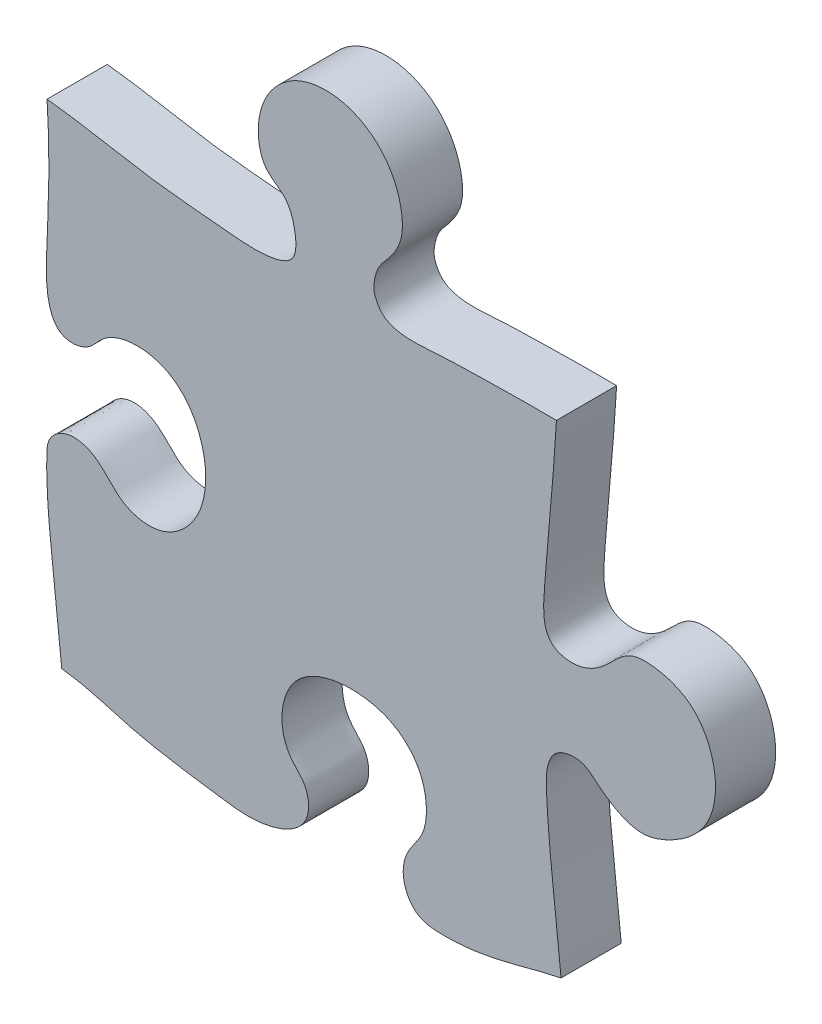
ISO-10303-21;
HEADER;
FILE_DESCRIPTION(('STEP AP214'),'2;1');
FILE_NAME('part.step','',(''),(''),'','','');
FILE_SCHEMA(('AUTOMOTIVE_DESIGN { 1 0 10303 214 1 1 1 1 }'));
ENDSEC;
DATA;
#1=APPLICATION_CONTEXT('core data for automotive mechanical design processes');
#2=APPLICATION_PROTOCOL_DEFINITION('international standard','automotive_design',2000,#1);
#3=PRODUCT_CONTEXT('',#1,'mechanical');
#4=PRODUCT('Part','Part','',(#3));
#5=PRODUCT_RELATED_PRODUCT_CATEGORY('part','',(#4));
#6=PRODUCT_DEFINITION_FORMATION('','',#4);
#7=PRODUCT_DEFINITION_CONTEXT('part definition',#1,'design');
#8=PRODUCT_DEFINITION('design','',#6,#7);
#9=PRODUCT_DEFINITION_SHAPE('','',#8);
#10=(LENGTH_UNIT() NAMED_UNIT(*) SI_UNIT(.MILLI.,.METRE.));
#11=(NAMED_UNIT(*) PLANE_ANGLE_UNIT() SI_UNIT($,.RADIAN.));
#12=(NAMED_UNIT(*) SI_UNIT($,.STERADIAN.) SOLID_ANGLE_UNIT());
#13=UNCERTAINTY_MEASURE_WITH_UNIT(LENGTH_MEASURE(1.E-05),#10,'distance_accuracy_value','');
#14=(GEOMETRIC_REPRESENTATION_CONTEXT(3) GLOBAL_UNCERTAINTY_ASSIGNED_CONTEXT((#13)) GLOBAL_UNIT_ASSIGNED_CONTEXT((#10,
#11,#12)) REPRESENTATION_CONTEXT('',''));
#15=CARTESIAN_POINT('',(0.,0.,0.));
#16=DIRECTION('',(0.,0.,1.));
#17=DIRECTION('',(1.,0.,0.));
#18=AXIS2_PLACEMENT_3D('',#15,#16,#17);
#19=CARTESIAN_POINT('',(325.257058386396,356.,-0.00999999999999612));
#20=CARTESIAN_POINT('',(320.961162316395,345.029410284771,-0.00999999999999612));
#21=CARTESIAN_POINT('',(320.821863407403,330.111228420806,-0.00999999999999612));
#22=CARTESIAN_POINT('',(317.746642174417,310.708405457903,-0.00999999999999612));
#23=CARTESIAN_POINT('',(324.80874526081,302.068845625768,-0.00999999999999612));
#24=CARTESIAN_POINT('',(334.47949844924,301.092198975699,-0.00999999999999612));
#25=CARTESIAN_POINT('',(341.199385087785,308.405018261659,-0.00999999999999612));
#26=CARTESIAN_POINT('',(351.88918877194,310.104343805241,-0.00999999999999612));
#27=CARTESIAN_POINT('',(365.477229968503,308.551893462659,-0.00999999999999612));
#28=CARTESIAN_POINT('',(373.973100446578,293.452904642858,-0.00999999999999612));
#29=CARTESIAN_POINT('',(374.68177629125,275.222888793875,-0.00999999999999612));
#30=CARTESIAN_POINT('',(363.969524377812,260.217712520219,-0.00999999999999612));
#31=CARTESIAN_POINT('',(347.560929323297,258.00994019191,-0.00999999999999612));
#32=CARTESIAN_POINT('',(341.667769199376,269.318092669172,-0.00999999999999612));
#33=CARTESIAN_POINT('',(329.050646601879,268.591464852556,-0.00999999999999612));
#34=CARTESIAN_POINT('',(320.333215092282,258.695380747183,-0.00999999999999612));
#35=CARTESIAN_POINT('',(321.071783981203,237.536716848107,-0.00999999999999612));
#36=CARTESIAN_POINT('',(324.445641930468,214.63289279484,-0.00999999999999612));
#37=CARTESIAN_POINT('',(329.382935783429,185.164436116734,-0.00999999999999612));
#38=CARTESIAN_POINT('',(327.148862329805,151.381238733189,-0.00999999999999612));
#39=CARTESIAN_POINT('',(325.104399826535,122.782989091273,-0.00999999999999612));
#40=CARTESIAN_POINT('',(327.870971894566,95.9027200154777,-0.00999999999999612));
#41=CARTESIAN_POINT('',(342.142457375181,93.3383677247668,-0.00999999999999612));
#42=CARTESIAN_POINT('',(347.900573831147,101.981576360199,-0.00999999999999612));
#43=CARTESIAN_POINT('',(356.834615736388,107.765098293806,-0.00999999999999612));
#44=CARTESIAN_POINT('',(369.379527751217,108.600772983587,-0.00999999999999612));
#45=CARTESIAN_POINT('',(380.120269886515,95.9775166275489,-0.00999999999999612));
#46=CARTESIAN_POINT('',(380.578851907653,78.7451628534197,-0.00999999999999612));
#47=CARTESIAN_POINT('',(375.610818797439,61.7248962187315,-0.00999999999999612));
#48=CARTESIAN_POINT('',(363.715824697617,52.8157722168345,-0.00999999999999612));
#49=CARTESIAN_POINT('',(349.85984979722,55.1705340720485,-0.00999999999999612));
#50=CARTESIAN_POINT('',(346.945856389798,64.810819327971,-0.00999999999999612));
#51=CARTESIAN_POINT('',(338.689797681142,70.9897723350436,-0.00999999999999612));
#52=CARTESIAN_POINT('',(330.580353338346,62.4728514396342,-0.00999999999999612));
#53=CARTESIAN_POINT('',(328.928359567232,48.4436203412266,-0.00999999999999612));
#54=CARTESIAN_POINT('',(329.318852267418,30.6791591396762,-0.00999999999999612));
#55=CARTESIAN_POINT('',(330.266196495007,6.75725364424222,-0.00999999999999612));
#56=CARTESIAN_POINT('',(328.413221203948,-22.8156731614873,-0.00999999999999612));
#57=CARTESIAN_POINT('',(325.957403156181,-47.4645191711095,-0.00999999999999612));
#58=CARTESIAN_POINT('',(324.284943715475,-71.7282942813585,-0.00999999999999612));
#59=CARTESIAN_POINT('',(336.158184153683,-74.5800053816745,-0.00999999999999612));
#60=CARTESIAN_POINT('',(345.605596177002,-70.2479425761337,-0.00999999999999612));
#61=CARTESIAN_POINT('',(352.349142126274,-60.6528291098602,-0.00999999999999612));
#62=CARTESIAN_POINT('',(364.054661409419,-61.084248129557,-0.00999999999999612));
#63=CARTESIAN_POINT('',(376.894401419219,-65.7171784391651,-0.00999999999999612));
#64=CARTESIAN_POINT('',(383.833690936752,-81.7570856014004,-0.00999999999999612));
#65=CARTESIAN_POINT('',(380.385627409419,-99.5380411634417,-0.00999999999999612));
#66=CARTESIAN_POINT('',(369.163029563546,-108.064440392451,-0.00999999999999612));
#67=CARTESIAN_POINT('',(355.487733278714,-112.894616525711,-0.00999999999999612));
#68=CARTESIAN_POINT('',(345.56890588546,-106.804716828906,-0.00999999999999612));
#69=CARTESIAN_POINT('',(337.864154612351,-99.6791187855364,-0.00999999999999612));
#70=CARTESIAN_POINT('',(325.333875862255,-101.340144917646,-0.00999999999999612));
#71=CARTESIAN_POINT('',(326.442256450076,-127.027418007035,-0.00999999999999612));
#72=CARTESIAN_POINT('',(328.990782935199,-147.650339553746,-0.00999999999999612));
#73=CARTESIAN_POINT('',(331.889209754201,-175.720931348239,-0.00999999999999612));
#74=CARTESIAN_POINT('',(333.49389611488,-200.043501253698,-0.00999999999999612));
#75=CARTESIAN_POINT('',(333.062418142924,-222.75850264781,-0.00999999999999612));
#76=CARTESIAN_POINT('',(334.041200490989,-241.335918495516,-0.00999999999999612));
#77=CARTESIAN_POINT('',(324.292862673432,-248.82670983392,-0.00999999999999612));
#78=CARTESIAN_POINT('',(313.862264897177,-249.831348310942,-0.00999999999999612));
#79=CARTESIAN_POINT('',(308.055191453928,-242.821422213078,-0.00999999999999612));
#80=CARTESIAN_POINT('',(300.480173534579,-235.015509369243,-0.00999999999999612));
#81=CARTESIAN_POINT('',(285.021810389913,-234.387092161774,-0.00999999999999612));
#82=CARTESIAN_POINT('',(274.179995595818,-248.432983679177,-0.00999999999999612));
#83=CARTESIAN_POINT('',(270.871780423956,-265.971502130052,-0.00999999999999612));
#84=CARTESIAN_POINT('',(274.212392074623,-284.032454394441,-0.00999999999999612));
#85=CARTESIAN_POINT('',(287.225269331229,-295.05235393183,-0.00999999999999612));
#86=CARTESIAN_POINT('',(300.809811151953,-292.931473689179,-0.00999999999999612));
#87=CARTESIAN_POINT('',(307.364923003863,-284.321305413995,-0.00999999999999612));
#88=CARTESIAN_POINT('',(317.634904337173,-281.646810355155,-0.00999999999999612));
#89=CARTESIAN_POINT('',(335.194502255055,-286.515768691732,-0.00999999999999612));
#90=CARTESIAN_POINT('',(329.900008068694,-321.054322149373,-0.00999999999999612));
#91=CARTESIAN_POINT('',(330.939416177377,-339.80390498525,-0.00999999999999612));
#92=CARTESIAN_POINT('',(328.124742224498,-356.,-0.00999999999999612));
#93=B_SPLINE_CURVE_WITH_KNOTS('',3,(#19,#20,#21,#22,#23,#24,#25,#26,#27,#28,#29,#30,#31,#32,#33,
#34,#35,#36,#37,#38,#39,#40,#41,#42,#43,#44,#45,#46,#47,#48,#49,#50,#51,#52,#53,#54,#55,#56,#57,
#58,#59,#60,#61,#62,#63,#64,#65,#66,#67,#68,#69,#70,#71,#72,#73,#74,#75,#76,#77,#78,#79,#80,#81,
#82,#83,#84,#85,#86,#87,#88,#89,#90,#91,#92),.UNSPECIFIED.,.F.,.F.,(4,1,1,1,1,1,1,1,1,1,1,1,1,1,
1,1,1,1,1,1,1,1,1,1,1,1,1,1,1,1,1,1,1,1,1,1,1,1,1,1,1,1,1,1,1,1,1,1,1,1,1,1,1,1,1,1,1,1,1,1,1,1,
1,1,1,1,1,1,1,1,1,4),(0.,0.0294359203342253,0.0410015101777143,0.0482578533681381,
0.056156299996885,0.0628725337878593,0.0726761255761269,0.0834491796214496,0.0961628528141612,
0.113582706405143,0.1292026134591,0.140393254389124,0.149299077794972,0.1578234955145,
0.168702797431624,0.18034067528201,0.211171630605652,0.230177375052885,0.258218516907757,
0.297936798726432,0.310855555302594,0.319545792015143,0.327782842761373,0.335750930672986,
0.347377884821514,0.35651553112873,0.375682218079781,0.389966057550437,0.401463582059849,
0.411615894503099,0.420595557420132,0.426581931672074,0.43417370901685,0.444880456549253,
0.464136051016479,0.480140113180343,0.507902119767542,0.539252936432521,0.552990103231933,
0.558383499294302,0.567729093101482,0.578921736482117,0.586248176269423,0.596305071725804,
0.613504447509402,0.626237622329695,0.64117705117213,0.647978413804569,0.662971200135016,
0.667795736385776,0.675224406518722,0.689293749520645,0.721613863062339,0.73643728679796,
0.762019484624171,0.785031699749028,0.797726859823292,0.806664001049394,0.814473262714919,
0.822386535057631,0.828765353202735,0.842978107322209,0.855573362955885,0.871677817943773,
0.889062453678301,0.900888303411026,0.912516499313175,0.920249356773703,0.928039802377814,
0.939164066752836,0.961164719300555,1.),.UNSPECIFIED.);
#94=DIRECTION('',(0.,0.,1.));
#95=VECTOR('',#94,1.);
#96=SURFACE_OF_LINEAR_EXTRUSION('',#93,#95);
#97=CARTESIAN_POINT('',(325.257058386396,356.,20.));
#98=CARTESIAN_POINT('',(320.961162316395,345.029410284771,20.));
#99=CARTESIAN_POINT('',(320.821863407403,330.111228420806,20.));
#100=CARTESIAN_POINT('',(317.746642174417,310.708405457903,20.));
#101=CARTESIAN_POINT('',(324.80874526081,302.068845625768,20.));
#102=CARTESIAN_POINT('',(334.47949844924,301.092198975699,20.));
#103=CARTESIAN_POINT('',(341.199385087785,308.405018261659,20.));
#104=CARTESIAN_POINT('',(351.88918877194,310.104343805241,20.));
#105=CARTESIAN_POINT('',(365.477229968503,308.551893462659,20.));
#106=CARTESIAN_POINT('',(373.973100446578,293.452904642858,20.));
#107=CARTESIAN_POINT('',(374.68177629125,275.222888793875,20.));
#108=CARTESIAN_POINT('',(363.969524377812,260.217712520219,20.));
#109=CARTESIAN_POINT('',(347.560929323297,258.00994019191,20.));
#110=CARTESIAN_POINT('',(341.667769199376,269.318092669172,20.));
#111=CARTESIAN_POINT('',(329.050646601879,268.591464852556,20.));
#112=CARTESIAN_POINT('',(320.333215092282,258.695380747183,20.));
#113=CARTESIAN_POINT('',(321.071783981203,237.536716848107,20.));
#114=CARTESIAN_POINT('',(324.445641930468,214.63289279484,20.));
#115=CARTESIAN_POINT('',(329.382935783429,185.164436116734,20.));
#116=CARTESIAN_POINT('',(327.148862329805,151.381238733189,20.));
#117=CARTESIAN_POINT('',(325.104399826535,122.782989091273,20.));
#118=CARTESIAN_POINT('',(327.870971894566,95.9027200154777,20.));
#119=CARTESIAN_POINT('',(342.142457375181,93.3383677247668,20.));
#120=CARTESIAN_POINT('',(347.900573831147,101.981576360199,20.));
#121=CARTESIAN_POINT('',(356.834615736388,107.765098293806,20.));
#122=CARTESIAN_POINT('',(369.379527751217,108.600772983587,20.));
#123=CARTESIAN_POINT('',(380.120269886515,95.9775166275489,20.));
#124=CARTESIAN_POINT('',(380.578851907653,78.7451628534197,20.));
#125=CARTESIAN_POINT('',(375.610818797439,61.7248962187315,20.));
#126=CARTESIAN_POINT('',(363.715824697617,52.8157722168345,20.));
#127=CARTESIAN_POINT('',(349.85984979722,55.1705340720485,20.));
#128=CARTESIAN_POINT('',(346.945856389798,64.810819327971,20.));
#129=CARTESIAN_POINT('',(338.689797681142,70.9897723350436,20.));
#130=CARTESIAN_POINT('',(330.580353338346,62.4728514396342,20.));
#131=CARTESIAN_POINT('',(328.928359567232,48.4436203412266,20.));
#132=CARTESIAN_POINT('',(329.318852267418,30.6791591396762,20.));
#133=CARTESIAN_POINT('',(330.266196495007,6.75725364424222,20.));
#134=CARTESIAN_POINT('',(328.413221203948,-22.8156731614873,20.));
#135=CARTESIAN_POINT('',(325.957403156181,-47.4645191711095,20.));
#136=CARTESIAN_POINT('',(324.284943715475,-71.7282942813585,20.));
#137=CARTESIAN_POINT('',(336.158184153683,-74.5800053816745,20.));
#138=CARTESIAN_POINT('',(345.605596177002,-70.2479425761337,20.));
#139=CARTESIAN_POINT('',(352.349142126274,-60.6528291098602,20.));
#140=CARTESIAN_POINT('',(364.054661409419,-61.084248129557,20.));
#141=CARTESIAN_POINT('',(376.894401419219,-65.7171784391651,20.));
#142=CARTESIAN_POINT('',(383.833690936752,-81.7570856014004,20.));
#143=CARTESIAN_POINT('',(380.385627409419,-99.5380411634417,20.));
#144=CARTESIAN_POINT('',(369.163029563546,-108.064440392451,20.));
#145=CARTESIAN_POINT('',(355.487733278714,-112.894616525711,20.));
#146=CARTESIAN_POINT('',(345.56890588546,-106.804716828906,20.));
#147=CARTESIAN_POINT('',(337.864154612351,-99.6791187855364,20.));
#148=CARTESIAN_POINT('',(325.333875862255,-101.340144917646,20.));
#149=CARTESIAN_POINT('',(326.442256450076,-127.027418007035,20.));
#150=CARTESIAN_POINT('',(328.990782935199,-147.650339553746,20.));
#151=CARTESIAN_POINT('',(331.889209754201,-175.720931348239,20.));
#152=CARTESIAN_POINT('',(333.49389611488,-200.043501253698,20.));
#153=CARTESIAN_POINT('',(333.062418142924,-222.75850264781,20.));
#154=CARTESIAN_POINT('',(334.041200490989,-241.335918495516,20.));
#155=CARTESIAN_POINT('',(324.292862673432,-248.82670983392,20.));
#156=CARTESIAN_POINT('',(313.862264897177,-249.831348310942,20.));
#157=CARTESIAN_POINT('',(308.055191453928,-242.821422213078,20.));
#158=CARTESIAN_POINT('',(300.480173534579,-235.015509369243,20.));
#159=CARTESIAN_POINT('',(285.021810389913,-234.387092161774,20.));
#160=CARTESIAN_POINT('',(274.179995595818,-248.432983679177,20.));
#161=CARTESIAN_POINT('',(270.871780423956,-265.971502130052,20.));
#162=CARTESIAN_POINT('',(274.212392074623,-284.032454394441,20.));
#163=CARTESIAN_POINT('',(287.225269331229,-295.05235393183,20.));
#164=CARTESIAN_POINT('',(300.809811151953,-292.931473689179,20.));
#165=CARTESIAN_POINT('',(307.364923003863,-284.321305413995,20.));
#166=CARTESIAN_POINT('',(317.634904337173,-281.646810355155,20.));
#167=CARTESIAN_POINT('',(335.194502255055,-286.515768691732,20.));
#168=CARTESIAN_POINT('',(329.900008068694,-321.054322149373,20.));
#169=CARTESIAN_POINT('',(330.939416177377,-339.80390498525,20.));
#170=CARTESIAN_POINT('',(328.124742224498,-356.,20.));
#171=B_SPLINE_CURVE_WITH_KNOTS('',3,(#97,#98,#99,#100,#101,#102,#103,#104,#105,#106,#107,#108,
#109,#110,#111,#112,#113,#114,#115,#116,#117,#118,#119,#120,#121,#122,#123,#124,#125,#126,#127,
#128,#129,#130,#131,#132,#133,#134,#135,#136,#137,#138,#139,#140,#141,#142,#143,#144,#145,#146,
#147,#148,#149,#150,#151,#152,#153,#154,#155,#156,#157,#158,#159,#160,#161,#162,#163,#164,#165,
#166,#167,#168,#169,#170),.UNSPECIFIED.,.F.,.F.,(4,1,1,1,1,1,1,1,1,1,1,1,1,1,1,1,1,1,1,1,1,1,1,
1,1,1,1,1,1,1,1,1,1,1,1,1,1,1,1,1,1,1,1,1,1,1,1,1,1,1,1,1,1,1,1,1,1,1,1,1,1,1,1,1,1,1,1,1,1,1,1,
4),(0.,0.0294359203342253,0.0410015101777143,0.0482578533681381,0.056156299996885,
0.0628725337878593,0.0726761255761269,0.0834491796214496,0.0961628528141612,0.113582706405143,
0.1292026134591,0.140393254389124,0.149299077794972,0.1578234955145,0.168702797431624,
0.18034067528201,0.211171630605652,0.230177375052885,0.258218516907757,0.297936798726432,
0.310855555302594,0.319545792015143,0.327782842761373,0.335750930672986,0.347377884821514,
0.35651553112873,0.375682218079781,0.389966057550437,0.401463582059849,0.411615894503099,
0.420595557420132,0.426581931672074,0.43417370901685,0.444880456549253,0.464136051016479,
0.480140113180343,0.507902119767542,0.539252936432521,0.552990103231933,0.558383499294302,
0.567729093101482,0.578921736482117,0.586248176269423,0.596305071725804,0.613504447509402,
0.626237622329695,0.64117705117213,0.647978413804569,0.662971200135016,0.667795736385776,
0.675224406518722,0.689293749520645,0.721613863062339,0.73643728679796,0.762019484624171,
0.785031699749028,0.797726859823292,0.806664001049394,0.814473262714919,0.822386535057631,
0.828765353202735,0.842978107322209,0.855573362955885,0.871677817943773,0.889062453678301,
0.900888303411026,0.912516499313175,0.920249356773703,0.928039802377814,0.939164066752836,
0.961164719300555,1.),.UNSPECIFIED.);
#172=CARTESIAN_POINT('',(329.347506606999,-6.46618719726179,20.));
#173=VERTEX_POINT('',#172);
#174=CARTESIAN_POINT('',(330.882415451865,-166.22555796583,20.));
#175=VERTEX_POINT('',#174);
#176=EDGE_CURVE('E11',#173,#175,#171,.T.);
#177=ORIENTED_EDGE('',*,*,#176,.T.);
#178=DIRECTION('',(0.,0.,1.));
#179=VECTOR('',#178,1.);
#180=CARTESIAN_POINT('',(330.88241545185,-166.225557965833,-0.00999999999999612));
#181=LINE('',#180,#179);
#182=CARTESIAN_POINT('',(330.882415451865,-166.22555796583,0.));
#183=VERTEX_POINT('',#182);
#184=EDGE_CURVE('E51',#175,#183,#181,.F.);
#185=ORIENTED_EDGE('',*,*,#184,.T.);
#186=CARTESIAN_POINT('',(325.257058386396,356.,0.));
#187=CARTESIAN_POINT('',(320.961162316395,345.029410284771,0.));
#188=CARTESIAN_POINT('',(320.821863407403,330.111228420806,0.));
#189=CARTESIAN_POINT('',(317.746642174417,310.708405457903,0.));
#190=CARTESIAN_POINT('',(324.80874526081,302.068845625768,0.));
#191=CARTESIAN_POINT('',(334.47949844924,301.092198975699,0.));
#192=CARTESIAN_POINT('',(341.199385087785,308.405018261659,0.));
#193=CARTESIAN_POINT('',(351.88918877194,310.104343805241,0.));
#194=CARTESIAN_POINT('',(365.477229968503,308.551893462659,0.));
#195=CARTESIAN_POINT('',(373.973100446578,293.452904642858,0.));
#196=CARTESIAN_POINT('',(374.68177629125,275.222888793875,0.));
#197=CARTESIAN_POINT('',(363.969524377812,260.217712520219,0.));
#198=CARTESIAN_POINT('',(347.560929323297,258.00994019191,0.));
#199=CARTESIAN_POINT('',(341.667769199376,269.318092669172,0.));
#200=CARTESIAN_POINT('',(329.050646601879,268.591464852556,0.));
#201=CARTESIAN_POINT('',(320.333215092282,258.695380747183,0.));
#202=CARTESIAN_POINT('',(321.071783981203,237.536716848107,0.));
#203=CARTESIAN_POINT('',(324.445641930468,214.63289279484,0.));
#204=CARTESIAN_POINT('',(329.382935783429,185.164436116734,0.));
#205=CARTESIAN_POINT('',(327.148862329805,151.381238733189,0.));
#206=CARTESIAN_POINT('',(325.104399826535,122.782989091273,0.));
#207=CARTESIAN_POINT('',(327.870971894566,95.9027200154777,0.));
#208=CARTESIAN_POINT('',(342.142457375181,93.3383677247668,0.));
#209=CARTESIAN_POINT('',(347.900573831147,101.981576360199,0.));
#210=CARTESIAN_POINT('',(356.834615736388,107.765098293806,0.));
#211=CARTESIAN_POINT('',(369.379527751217,108.600772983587,0.));
#212=CARTESIAN_POINT('',(380.120269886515,95.9775166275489,0.));
#213=CARTESIAN_POINT('',(380.578851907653,78.7451628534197,0.));
#214=CARTESIAN_POINT('',(375.610818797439,61.7248962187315,0.));
#215=CARTESIAN_POINT('',(363.715824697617,52.8157722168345,0.));
#216=CARTESIAN_POINT('',(349.85984979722,55.1705340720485,0.));
#217=CARTESIAN_POINT('',(346.945856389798,64.810819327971,0.));
#218=CARTESIAN_POINT('',(338.689797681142,70.9897723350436,0.));
#219=CARTESIAN_POINT('',(330.580353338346,62.4728514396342,0.));
#220=CARTESIAN_POINT('',(328.928359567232,48.4436203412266,0.));
#221=CARTESIAN_POINT('',(329.318852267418,30.6791591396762,0.));
#222=CARTESIAN_POINT('',(330.266196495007,6.75725364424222,0.));
#223=CARTESIAN_POINT('',(328.413221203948,-22.8156731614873,0.));
#224=CARTESIAN_POINT('',(325.957403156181,-47.4645191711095,0.));
#225=CARTESIAN_POINT('',(324.284943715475,-71.7282942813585,0.));
#226=CARTESIAN_POINT('',(336.158184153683,-74.5800053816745,0.));
#227=CARTESIAN_POINT('',(345.605596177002,-70.2479425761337,0.));
#228=CARTESIAN_POINT('',(352.349142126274,-60.6528291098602,0.));
#229=CARTESIAN_POINT('',(364.054661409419,-61.084248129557,0.));
#230=CARTESIAN_POINT('',(376.894401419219,-65.7171784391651,0.));
#231=CARTESIAN_POINT('',(383.833690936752,-81.7570856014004,0.));
#232=CARTESIAN_POINT('',(380.385627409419,-99.5380411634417,0.));
#233=CARTESIAN_POINT('',(369.163029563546,-108.064440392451,0.));
#234=CARTESIAN_POINT('',(355.487733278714,-112.894616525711,0.));
#235=CARTESIAN_POINT('',(345.56890588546,-106.804716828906,0.));
#236=CARTESIAN_POINT('',(337.864154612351,-99.6791187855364,0.));
#237=CARTESIAN_POINT('',(325.333875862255,-101.340144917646,0.));
#238=CARTESIAN_POINT('',(326.442256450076,-127.027418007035,0.));
#239=CARTESIAN_POINT('',(328.990782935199,-147.650339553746,0.));
#240=CARTESIAN_POINT('',(331.889209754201,-175.720931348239,0.));
#241=CARTESIAN_POINT('',(333.49389611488,-200.043501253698,0.));
#242=CARTESIAN_POINT('',(333.062418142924,-222.75850264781,0.));
#243=CARTESIAN_POINT('',(334.041200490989,-241.335918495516,0.));
#244=CARTESIAN_POINT('',(324.292862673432,-248.82670983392,0.));
#245=CARTESIAN_POINT('',(313.862264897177,-249.831348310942,0.));
#246=CARTESIAN_POINT('',(308.055191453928,-242.821422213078,0.));
#247=CARTESIAN_POINT('',(300.480173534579,-235.015509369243,0.));
#248=CARTESIAN_POINT('',(285.021810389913,-234.387092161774,0.));
#249=CARTESIAN_POINT('',(274.179995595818,-248.432983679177,0.));
#250=CARTESIAN_POINT('',(270.871780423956,-265.971502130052,0.));
#251=CARTESIAN_POINT('',(274.212392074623,-284.032454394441,0.));
#252=CARTESIAN_POINT('',(287.225269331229,-295.05235393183,0.));
#253=CARTESIAN_POINT('',(300.809811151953,-292.931473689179,0.));
#254=CARTESIAN_POINT('',(307.364923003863,-284.321305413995,0.));
#255=CARTESIAN_POINT('',(317.634904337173,-281.646810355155,0.));
#256=CARTESIAN_POINT('',(335.194502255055,-286.515768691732,0.));
#257=CARTESIAN_POINT('',(329.900008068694,-321.054322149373,0.));
#258=CARTESIAN_POINT('',(330.939416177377,-339.80390498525,0.));
#259=CARTESIAN_POINT('',(328.124742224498,-356.,0.));
#260=B_SPLINE_CURVE_WITH_KNOTS('',3,(#186,#187,#188,#189,#190,#191,#192,#193,#194,#195,#196,
#197,#198,#199,#200,#201,#202,#203,#204,#205,#206,#207,#208,#209,#210,#211,#212,#213,#214,#215,
#216,#217,#218,#219,#220,#221,#222,#223,#224,#225,#226,#227,#228,#229,#230,#231,#232,#233,#234,
#235,#236,#237,#238,#239,#240,#241,#242,#243,#244,#245,#246,#247,#248,#249,#250,#251,#252,#253,
#254,#255,#256,#257,#258,#259),.UNSPECIFIED.,.F.,.F.,(4,1,1,1,1,1,1,1,1,1,1,1,1,1,1,1,1,1,1,1,1,
1,1,1,1,1,1,1,1,1,1,1,1,1,1,1,1,1,1,1,1,1,1,1,1,1,1,1,1,1,1,1,1,1,1,1,1,1,1,1,1,1,1,1,1,1,1,1,1,
1,1,4),(0.,0.0294359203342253,0.0410015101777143,0.0482578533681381,0.056156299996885,
0.0628725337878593,0.0726761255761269,0.0834491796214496,0.0961628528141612,0.113582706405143,
0.1292026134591,0.140393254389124,0.149299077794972,0.1578234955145,0.168702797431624,
0.18034067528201,0.211171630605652,0.230177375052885,0.258218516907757,0.297936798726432,
0.310855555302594,0.319545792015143,0.327782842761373,0.335750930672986,0.347377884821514,
0.35651553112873,0.375682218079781,0.389966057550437,0.401463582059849,0.411615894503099,
0.420595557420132,0.426581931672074,0.43417370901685,0.444880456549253,0.464136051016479,
0.480140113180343,0.507902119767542,0.539252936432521,0.552990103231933,0.558383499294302,
0.567729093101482,0.578921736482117,0.586248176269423,0.596305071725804,0.613504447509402,
0.626237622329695,0.64117705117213,0.647978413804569,0.662971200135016,0.667795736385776,
0.675224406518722,0.689293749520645,0.721613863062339,0.73643728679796,0.762019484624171,
0.785031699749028,0.797726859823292,0.806664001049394,0.814473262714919,0.822386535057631,
0.828765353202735,0.842978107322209,0.855573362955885,0.871677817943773,0.889062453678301,
0.900888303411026,0.912516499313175,0.920249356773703,0.928039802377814,0.939164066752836,
0.961164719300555,1.),.UNSPECIFIED.);
#261=CARTESIAN_POINT('',(329.347506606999,-6.46618719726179,0.));
#262=VERTEX_POINT('',#261);
#263=EDGE_CURVE('E87',#262,#183,#260,.T.);
#264=ORIENTED_EDGE('',*,*,#263,.F.);
#265=DIRECTION('',(0.,0.,1.));
#266=VECTOR('',#265,1.);
#267=CARTESIAN_POINT('',(329.347506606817,-6.46618719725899,-0.00999999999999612));
#268=LINE('',#267,#266);
#269=EDGE_CURVE('E57',#173,#262,#268,.F.);
#270=ORIENTED_EDGE('',*,*,#269,.F.);
#271=EDGE_LOOP('',(#177,#185,#264,#270));
#272=FACE_BOUND('',#271,.T.);
#273=ADVANCED_FACE('F34',(#272),#96,.F.);
#274=CARTESIAN_POINT('',(164.700455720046,356.,-0.00999999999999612));
#275=CARTESIAN_POINT('',(166.684488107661,335.198470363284,-0.00999999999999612));
#276=CARTESIAN_POINT('',(165.501961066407,316.54844325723,-0.00999999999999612));
#277=CARTESIAN_POINT('',(164.960386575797,287.97241381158,-0.00999999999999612));
#278=CARTESIAN_POINT('',(152.647306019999,285.390744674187,-0.00999999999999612));
#279=CARTESIAN_POINT('',(146.755099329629,295.454986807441,-0.00999999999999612));
#280=CARTESIAN_POINT('',(133.057911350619,298.241097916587,-0.00999999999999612));
#281=CARTESIAN_POINT('',(118.543117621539,289.096389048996,-0.00999999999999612));
#282=CARTESIAN_POINT('',(110.066069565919,270.786201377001,-0.00999999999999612));
#283=CARTESIAN_POINT('',(115.81886117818,249.01949577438,-0.00999999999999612));
#284=CARTESIAN_POINT('',(132.43055469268,243.861484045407,-0.00999999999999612));
#285=CARTESIAN_POINT('',(145.190771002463,247.721589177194,-0.00999999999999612));
#286=CARTESIAN_POINT('',(150.073688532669,259.755128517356,-0.00999999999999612));
#287=CARTESIAN_POINT('',(164.873456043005,258.011209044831,-0.00999999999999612));
#288=CARTESIAN_POINT('',(166.852874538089,244.914449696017,-0.00999999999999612));
#289=CARTESIAN_POINT('',(165.64887314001,235.496089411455,-0.00999999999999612));
#290=CARTESIAN_POINT('',(164.287273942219,218.693357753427,-0.00999999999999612));
#291=CARTESIAN_POINT('',(162.190296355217,197.368034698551,-0.00999999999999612));
#292=CARTESIAN_POINT('',(156.3242571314,163.987545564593,-0.00999999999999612));
#293=CARTESIAN_POINT('',(154.411282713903,133.17643128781,-0.00999999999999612));
#294=CARTESIAN_POINT('',(156.534624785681,107.79955112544,-0.00999999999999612));
#295=CARTESIAN_POINT('',(165.683431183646,96.7362595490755,-0.00999999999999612));
#296=CARTESIAN_POINT('',(175.741034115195,97.7165246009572,-0.00999999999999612));
#297=CARTESIAN_POINT('',(178.913476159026,105.433342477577,-0.00999999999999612));
#298=CARTESIAN_POINT('',(187.788546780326,107.088038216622,-0.00999999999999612));
#299=CARTESIAN_POINT('',(196.945345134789,104.662624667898,-0.00999999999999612));
#300=CARTESIAN_POINT('',(205.29981235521,92.5405980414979,-0.00999999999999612));
#301=CARTESIAN_POINT('',(205.41693478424,76.2178133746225,-0.00999999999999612));
#302=CARTESIAN_POINT('',(199.239540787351,59.8870096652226,-0.00999999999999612));
#303=CARTESIAN_POINT('',(186.871281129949,54.774238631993,-0.00999999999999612));
#304=CARTESIAN_POINT('',(176.156697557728,56.844920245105,-0.00999999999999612));
#305=CARTESIAN_POINT('',(170.099360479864,65.2771221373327,-0.00999999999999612));
#306=CARTESIAN_POINT('',(157.970826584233,62.7514417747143,-0.00999999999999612));
#307=CARTESIAN_POINT('',(154.504441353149,46.6972732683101,-0.00999999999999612));
#308=CARTESIAN_POINT('',(156.826886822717,28.5222575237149,-0.00999999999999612));
#309=CARTESIAN_POINT('',(160.951813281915,-0.904965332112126,-0.00999999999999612));
#310=CARTESIAN_POINT('',(160.817443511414,-23.2712614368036,-0.00999999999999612));
#311=CARTESIAN_POINT('',(159.515162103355,-48.5242453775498,-0.00999999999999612));
#312=CARTESIAN_POINT('',(159.855435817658,-66.2012023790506,-0.00999999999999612));
#313=CARTESIAN_POINT('',(174.098925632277,-64.1326131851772,-0.00999999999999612));
#314=CARTESIAN_POINT('',(178.558905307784,-57.1982656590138,-0.00999999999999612));
#315=CARTESIAN_POINT('',(189.170801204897,-53.4758485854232,-0.00999999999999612));
#316=CARTESIAN_POINT('',(204.121791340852,-56.9229006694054,-0.00999999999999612));
#317=CARTESIAN_POINT('',(214.382314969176,-74.3254117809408,-0.00999999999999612));
#318=CARTESIAN_POINT('',(212.434433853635,-94.56819618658,-0.00999999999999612));
#319=CARTESIAN_POINT('',(198.400882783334,-105.927100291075,-0.00999999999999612));
#320=CARTESIAN_POINT('',(183.864051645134,-103.318484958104,-0.00999999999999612));
#321=CARTESIAN_POINT('',(177.484460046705,-92.9196706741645,-0.00999999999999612));
#322=CARTESIAN_POINT('',(166.612136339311,-90.3684772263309,-0.00999999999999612));
#323=CARTESIAN_POINT('',(160.072685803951,-95.573386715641,-0.00999999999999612));
#324=CARTESIAN_POINT('',(159.605088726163,-111.518801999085,-0.00999999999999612));
#325=CARTESIAN_POINT('',(161.971531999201,-132.152629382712,-0.00999999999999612));
#326=CARTESIAN_POINT('',(165.531009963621,-165.300059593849,-0.00999999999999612));
#327=CARTESIAN_POINT('',(167.927544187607,-195.365052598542,-0.00999999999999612));
#328=CARTESIAN_POINT('',(172.57489134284,-240.687787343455,-0.00999999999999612));
#329=CARTESIAN_POINT('',(151.998880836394,-237.677540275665,-0.00999999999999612));
#330=CARTESIAN_POINT('',(144.556929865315,-230.426442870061,-0.00999999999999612));
#331=CARTESIAN_POINT('',(127.822205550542,-229.966972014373,-0.00999999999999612));
#332=CARTESIAN_POINT('',(119.338975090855,-241.300441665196,-0.00999999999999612));
#333=CARTESIAN_POINT('',(116.55363668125,-259.024274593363,-0.00999999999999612));
#334=CARTESIAN_POINT('',(116.920126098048,-276.665079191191,-0.00999999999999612));
#335=CARTESIAN_POINT('',(139.807593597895,-286.808161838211,-0.00999999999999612));
#336=CARTESIAN_POINT('',(149.426451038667,-271.120437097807,-0.00999999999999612));
#337=CARTESIAN_POINT('',(164.833722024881,-276.098774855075,-0.00999999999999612));
#338=CARTESIAN_POINT('',(167.534498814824,-298.611176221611,-0.00999999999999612));
#339=CARTESIAN_POINT('',(167.66539945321,-324.44648435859,-0.00999999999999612));
#340=CARTESIAN_POINT('',(167.206886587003,-345.801767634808,-0.00999999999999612));
#341=CARTESIAN_POINT('',(167.126415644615,-356.,-0.00999999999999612));
#342=B_SPLINE_CURVE_WITH_KNOTS('',3,(#274,#275,#276,#277,#278,#279,#280,#281,#282,#283,#284,
#285,#286,#287,#288,#289,#290,#291,#292,#293,#294,#295,#296,#297,#298,#299,#300,#301,#302,#303,
#304,#305,#306,#307,#308,#309,#310,#311,#312,#313,#314,#315,#316,#317,#318,#319,#320,#321,#322,
#323,#324,#325,#326,#327,#328,#329,#330,#331,#332,#333,#334,#335,#336,#337,#338,#339,#340,#341),
.UNSPECIFIED.,.F.,.F.,(4,1,1,1,1,1,1,1,1,1,1,1,1,1,1,1,1,1,1,1,1,1,1,1,1,1,1,1,1,1,1,1,1,1,1,1,
1,1,1,1,1,1,1,1,1,1,1,1,1,1,1,1,1,1,1,1,1,1,1,1,1,1,1,1,1,4),(0.,0.0528861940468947,
0.0611638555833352,0.0696733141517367,0.078438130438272,0.090018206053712,0.103675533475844,
0.122333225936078,0.142560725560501,0.155895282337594,0.165515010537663,0.176439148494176,
0.187171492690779,0.194785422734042,0.209132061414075,0.213814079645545,0.241605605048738,
0.267229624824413,0.306753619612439,0.326390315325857,0.335466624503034,0.342457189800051,
0.349640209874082,0.355564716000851,0.365339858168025,0.374043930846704,0.393709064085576,
0.408072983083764,0.418687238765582,0.427525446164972,0.43602306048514,0.444515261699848,
0.454494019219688,0.476412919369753,0.496275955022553,0.534624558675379,0.541144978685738,
0.561480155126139,0.567662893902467,0.574392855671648,0.583113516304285,0.596680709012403,
0.612912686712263,0.634082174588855,0.646626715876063,0.657822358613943,0.669754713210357,
0.678210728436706,0.685129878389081,0.689092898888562,0.71784093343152,0.747115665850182,
0.77522808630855,0.815611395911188,0.819725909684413,0.828398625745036,0.84335213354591,
0.85870373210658,0.863219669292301,0.888511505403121,0.901615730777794,0.918667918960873,
0.92637935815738,0.939283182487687,0.973955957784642,1.),.UNSPECIFIED.);
#343=DIRECTION('',(0.,0.,1.));
#344=VECTOR('',#343,1.);
#345=SURFACE_OF_LINEAR_EXTRUSION('',#342,#344);
#346=CARTESIAN_POINT('',(164.700455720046,356.,20.));
#347=CARTESIAN_POINT('',(166.684488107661,335.198470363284,20.));
#348=CARTESIAN_POINT('',(165.501961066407,316.54844325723,20.));
#349=CARTESIAN_POINT('',(164.960386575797,287.97241381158,20.));
#350=CARTESIAN_POINT('',(152.647306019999,285.390744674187,20.));
#351=CARTESIAN_POINT('',(146.755099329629,295.454986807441,20.));
#352=CARTESIAN_POINT('',(133.057911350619,298.241097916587,20.));
#353=CARTESIAN_POINT('',(118.543117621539,289.096389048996,20.));
#354=CARTESIAN_POINT('',(110.066069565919,270.786201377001,20.));
#355=CARTESIAN_POINT('',(115.81886117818,249.01949577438,20.));
#356=CARTESIAN_POINT('',(132.43055469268,243.861484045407,20.));
#357=CARTESIAN_POINT('',(145.190771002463,247.721589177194,20.));
#358=CARTESIAN_POINT('',(150.073688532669,259.755128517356,20.));
#359=CARTESIAN_POINT('',(164.873456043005,258.011209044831,20.));
#360=CARTESIAN_POINT('',(166.852874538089,244.914449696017,20.));
#361=CARTESIAN_POINT('',(165.64887314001,235.496089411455,20.));
#362=CARTESIAN_POINT('',(164.287273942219,218.693357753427,20.));
#363=CARTESIAN_POINT('',(162.190296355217,197.368034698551,20.));
#364=CARTESIAN_POINT('',(156.3242571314,163.987545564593,20.));
#365=CARTESIAN_POINT('',(154.411282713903,133.17643128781,20.));
#366=CARTESIAN_POINT('',(156.534624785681,107.79955112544,20.));
#367=CARTESIAN_POINT('',(165.683431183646,96.7362595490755,20.));
#368=CARTESIAN_POINT('',(175.741034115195,97.7165246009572,20.));
#369=CARTESIAN_POINT('',(178.913476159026,105.433342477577,20.));
#370=CARTESIAN_POINT('',(187.788546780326,107.088038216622,20.));
#371=CARTESIAN_POINT('',(196.945345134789,104.662624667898,20.));
#372=CARTESIAN_POINT('',(205.29981235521,92.5405980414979,20.));
#373=CARTESIAN_POINT('',(205.41693478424,76.2178133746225,20.));
#374=CARTESIAN_POINT('',(199.239540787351,59.8870096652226,20.));
#375=CARTESIAN_POINT('',(186.871281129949,54.774238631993,20.));
#376=CARTESIAN_POINT('',(176.156697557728,56.844920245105,20.));
#377=CARTESIAN_POINT('',(170.099360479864,65.2771221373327,20.));
#378=CARTESIAN_POINT('',(157.970826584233,62.7514417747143,20.));
#379=CARTESIAN_POINT('',(154.504441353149,46.6972732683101,20.));
#380=CARTESIAN_POINT('',(156.826886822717,28.5222575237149,20.));
#381=CARTESIAN_POINT('',(160.951813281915,-0.904965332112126,20.));
#382=CARTESIAN_POINT('',(160.817443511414,-23.2712614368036,20.));
#383=CARTESIAN_POINT('',(159.515162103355,-48.5242453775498,20.));
#384=CARTESIAN_POINT('',(159.855435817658,-66.2012023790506,20.));
#385=CARTESIAN_POINT('',(174.098925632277,-64.1326131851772,20.));
#386=CARTESIAN_POINT('',(178.558905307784,-57.1982656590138,20.));
#387=CARTESIAN_POINT('',(189.170801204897,-53.4758485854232,20.));
#388=CARTESIAN_POINT('',(204.121791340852,-56.9229006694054,20.));
#389=CARTESIAN_POINT('',(214.382314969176,-74.3254117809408,20.));
#390=CARTESIAN_POINT('',(212.434433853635,-94.56819618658,20.));
#391=CARTESIAN_POINT('',(198.400882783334,-105.927100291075,20.));
#392=CARTESIAN_POINT('',(183.864051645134,-103.318484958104,20.));
#393=CARTESIAN_POINT('',(177.484460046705,-92.9196706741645,20.));
#394=CARTESIAN_POINT('',(166.612136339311,-90.3684772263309,20.));
#395=CARTESIAN_POINT('',(160.072685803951,-95.573386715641,20.));
#396=CARTESIAN_POINT('',(159.605088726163,-111.518801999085,20.));
#397=CARTESIAN_POINT('',(161.971531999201,-132.152629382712,20.));
#398=CARTESIAN_POINT('',(165.531009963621,-165.300059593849,20.));
#399=CARTESIAN_POINT('',(167.927544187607,-195.365052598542,20.));
#400=CARTESIAN_POINT('',(172.57489134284,-240.687787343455,20.));
#401=CARTESIAN_POINT('',(151.998880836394,-237.677540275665,20.));
#402=CARTESIAN_POINT('',(144.556929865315,-230.426442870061,20.));
#403=CARTESIAN_POINT('',(127.822205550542,-229.966972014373,20.));
#404=CARTESIAN_POINT('',(119.338975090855,-241.300441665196,20.));
#405=CARTESIAN_POINT('',(116.55363668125,-259.024274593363,20.));
#406=CARTESIAN_POINT('',(116.920126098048,-276.665079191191,20.));
#407=CARTESIAN_POINT('',(139.807593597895,-286.808161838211,20.));
#408=CARTESIAN_POINT('',(149.426451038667,-271.120437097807,20.));
#409=CARTESIAN_POINT('',(164.833722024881,-276.098774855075,20.));
#410=CARTESIAN_POINT('',(167.534498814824,-298.611176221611,20.));
#411=CARTESIAN_POINT('',(167.66539945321,-324.44648435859,20.));
#412=CARTESIAN_POINT('',(167.206886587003,-345.801767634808,20.));
#413=CARTESIAN_POINT('',(167.126415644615,-356.,20.));
#414=B_SPLINE_CURVE_WITH_KNOTS('',3,(#346,#347,#348,#349,#350,#351,#352,#353,#354,#355,#356,
#357,#358,#359,#360,#361,#362,#363,#364,#365,#366,#367,#368,#369,#370,#371,#372,#373,#374,#375,
#376,#377,#378,#379,#380,#381,#382,#383,#384,#385,#386,#387,#388,#389,#390,#391,#392,#393,#394,
#395,#396,#397,#398,#399,#400,#401,#402,#403,#404,#405,#406,#407,#408,#409,#410,#411,#412,#413),
.UNSPECIFIED.,.F.,.F.,(4,1,1,1,1,1,1,1,1,1,1,1,1,1,1,1,1,1,1,1,1,1,1,1,1,1,1,1,1,1,1,1,1,1,1,1,
1,1,1,1,1,1,1,1,1,1,1,1,1,1,1,1,1,1,1,1,1,1,1,1,1,1,1,1,1,4),(0.,0.0528861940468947,
0.0611638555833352,0.0696733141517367,0.078438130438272,0.090018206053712,0.103675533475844,
0.122333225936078,0.142560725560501,0.155895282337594,0.165515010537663,0.176439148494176,
0.187171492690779,0.194785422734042,0.209132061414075,0.213814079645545,0.241605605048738,
0.267229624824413,0.306753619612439,0.326390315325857,0.335466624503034,0.342457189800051,
0.349640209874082,0.355564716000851,0.365339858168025,0.374043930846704,0.393709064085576,
0.408072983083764,0.418687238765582,0.427525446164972,0.43602306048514,0.444515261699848,
0.454494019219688,0.476412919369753,0.496275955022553,0.534624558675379,0.541144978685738,
0.561480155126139,0.567662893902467,0.574392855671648,0.583113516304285,0.596680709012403,
0.612912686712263,0.634082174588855,0.646626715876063,0.657822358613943,0.669754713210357,
0.678210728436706,0.685129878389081,0.689092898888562,0.71784093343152,0.747115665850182,
0.77522808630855,0.815611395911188,0.819725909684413,0.828398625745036,0.84335213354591,
0.85870373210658,0.863219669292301,0.888511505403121,0.901615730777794,0.918667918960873,
0.92637935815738,0.939283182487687,0.973955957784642,1.),.UNSPECIFIED.);
#415=CARTESIAN_POINT('',(160.020895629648,1.33334492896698,20.));
#416=VERTEX_POINT('',#415);
#417=CARTESIAN_POINT('',(164.89714626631,-160.138848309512,20.));
#418=VERTEX_POINT('',#417);
#419=EDGE_CURVE('E78',#416,#418,#414,.T.);
#420=ORIENTED_EDGE('',*,*,#419,.F.);
#421=DIRECTION('',(0.,0.,1.));
#422=VECTOR('',#421,1.);
#423=CARTESIAN_POINT('',(160.020895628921,1.33334492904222,-0.00999999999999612));
#424=LINE('',#423,#422);
#425=CARTESIAN_POINT('',(160.020895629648,1.33334492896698,0.));
#426=VERTEX_POINT('',#425);
#427=EDGE_CURVE('E38',#416,#426,#424,.F.);
#428=ORIENTED_EDGE('',*,*,#427,.T.);
#429=CARTESIAN_POINT('',(164.700455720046,356.,0.));
#430=CARTESIAN_POINT('',(166.684488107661,335.198470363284,0.));
#431=CARTESIAN_POINT('',(165.501961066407,316.54844325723,0.));
#432=CARTESIAN_POINT('',(164.960386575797,287.97241381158,0.));
#433=CARTESIAN_POINT('',(152.647306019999,285.390744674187,0.));
#434=CARTESIAN_POINT('',(146.755099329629,295.454986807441,0.));
#435=CARTESIAN_POINT('',(133.057911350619,298.241097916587,0.));
#436=CARTESIAN_POINT('',(118.543117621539,289.096389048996,0.));
#437=CARTESIAN_POINT('',(110.066069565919,270.786201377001,0.));
#438=CARTESIAN_POINT('',(115.81886117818,249.01949577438,0.));
#439=CARTESIAN_POINT('',(132.43055469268,243.861484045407,0.));
#440=CARTESIAN_POINT('',(145.190771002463,247.721589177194,0.));
#441=CARTESIAN_POINT('',(150.073688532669,259.755128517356,0.));
#442=CARTESIAN_POINT('',(164.873456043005,258.011209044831,0.));
#443=CARTESIAN_POINT('',(166.852874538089,244.914449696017,0.));
#444=CARTESIAN_POINT('',(165.64887314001,235.496089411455,0.));
#445=CARTESIAN_POINT('',(164.287273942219,218.693357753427,0.));
#446=CARTESIAN_POINT('',(162.190296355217,197.368034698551,0.));
#447=CARTESIAN_POINT('',(156.3242571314,163.987545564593,0.));
#448=CARTESIAN_POINT('',(154.411282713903,133.17643128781,0.));
#449=CARTESIAN_POINT('',(156.534624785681,107.79955112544,0.));
#450=CARTESIAN_POINT('',(165.683431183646,96.7362595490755,0.));
#451=CARTESIAN_POINT('',(175.741034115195,97.7165246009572,0.));
#452=CARTESIAN_POINT('',(178.913476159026,105.433342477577,0.));
#453=CARTESIAN_POINT('',(187.788546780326,107.088038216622,0.));
#454=CARTESIAN_POINT('',(196.945345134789,104.662624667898,0.));
#455=CARTESIAN_POINT('',(205.29981235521,92.5405980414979,0.));
#456=CARTESIAN_POINT('',(205.41693478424,76.2178133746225,0.));
#457=CARTESIAN_POINT('',(199.239540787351,59.8870096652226,0.));
#458=CARTESIAN_POINT('',(186.871281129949,54.774238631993,0.));
#459=CARTESIAN_POINT('',(176.156697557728,56.844920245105,0.));
#460=CARTESIAN_POINT('',(170.099360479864,65.2771221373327,0.));
#461=CARTESIAN_POINT('',(157.970826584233,62.7514417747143,0.));
#462=CARTESIAN_POINT('',(154.504441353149,46.6972732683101,0.));
#463=CARTESIAN_POINT('',(156.826886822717,28.5222575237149,0.));
#464=CARTESIAN_POINT('',(160.951813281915,-0.904965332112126,0.));
#465=CARTESIAN_POINT('',(160.817443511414,-23.2712614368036,0.));
#466=CARTESIAN_POINT('',(159.515162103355,-48.5242453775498,0.));
#467=CARTESIAN_POINT('',(159.855435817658,-66.2012023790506,0.));
#468=CARTESIAN_POINT('',(174.098925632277,-64.1326131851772,0.));
#469=CARTESIAN_POINT('',(178.558905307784,-57.1982656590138,0.));
#470=CARTESIAN_POINT('',(189.170801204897,-53.4758485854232,0.));
#471=CARTESIAN_POINT('',(204.121791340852,-56.9229006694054,0.));
#472=CARTESIAN_POINT('',(214.382314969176,-74.3254117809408,0.));
#473=CARTESIAN_POINT('',(212.434433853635,-94.56819618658,0.));
#474=CARTESIAN_POINT('',(198.400882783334,-105.927100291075,0.));
#475=CARTESIAN_POINT('',(183.864051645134,-103.318484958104,0.));
#476=CARTESIAN_POINT('',(177.484460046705,-92.9196706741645,0.));
#477=CARTESIAN_POINT('',(166.612136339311,-90.3684772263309,0.));
#478=CARTESIAN_POINT('',(160.072685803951,-95.573386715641,0.));
#479=CARTESIAN_POINT('',(159.605088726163,-111.518801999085,0.));
#480=CARTESIAN_POINT('',(161.971531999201,-132.152629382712,0.));
#481=CARTESIAN_POINT('',(165.531009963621,-165.300059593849,0.));
#482=CARTESIAN_POINT('',(167.927544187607,-195.365052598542,0.));
#483=CARTESIAN_POINT('',(172.57489134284,-240.687787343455,0.));
#484=CARTESIAN_POINT('',(151.998880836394,-237.677540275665,0.));
#485=CARTESIAN_POINT('',(144.556929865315,-230.426442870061,0.));
#486=CARTESIAN_POINT('',(127.822205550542,-229.966972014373,0.));
#487=CARTESIAN_POINT('',(119.338975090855,-241.300441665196,0.));
#488=CARTESIAN_POINT('',(116.55363668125,-259.024274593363,0.));
#489=CARTESIAN_POINT('',(116.920126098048,-276.665079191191,0.));
#490=CARTESIAN_POINT('',(139.807593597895,-286.808161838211,0.));
#491=CARTESIAN_POINT('',(149.426451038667,-271.120437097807,0.));
#492=CARTESIAN_POINT('',(164.833722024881,-276.098774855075,0.));
#493=CARTESIAN_POINT('',(167.534498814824,-298.611176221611,0.));
#494=CARTESIAN_POINT('',(167.66539945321,-324.44648435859,0.));
#495=CARTESIAN_POINT('',(167.206886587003,-345.801767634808,0.));
#496=CARTESIAN_POINT('',(167.126415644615,-356.,0.));
#497=B_SPLINE_CURVE_WITH_KNOTS('',3,(#429,#430,#431,#432,#433,#434,#435,#436,#437,#438,#439,
#440,#441,#442,#443,#444,#445,#446,#447,#448,#449,#450,#451,#452,#453,#454,#455,#456,#457,#458,
#459,#460,#461,#462,#463,#464,#465,#466,#467,#468,#469,#470,#471,#472,#473,#474,#475,#476,#477,
#478,#479,#480,#481,#482,#483,#484,#485,#486,#487,#488,#489,#490,#491,#492,#493,#494,#495,#496),
.UNSPECIFIED.,.F.,.F.,(4,1,1,1,1,1,1,1,1,1,1,1,1,1,1,1,1,1,1,1,1,1,1,1,1,1,1,1,1,1,1,1,1,1,1,1,
1,1,1,1,1,1,1,1,1,1,1,1,1,1,1,1,1,1,1,1,1,1,1,1,1,1,1,1,1,4),(0.,0.0528861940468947,
0.0611638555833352,0.0696733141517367,0.078438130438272,0.090018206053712,0.103675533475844,
0.122333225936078,0.142560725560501,0.155895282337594,0.165515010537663,0.176439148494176,
0.187171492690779,0.194785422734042,0.209132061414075,0.213814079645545,0.241605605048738,
0.267229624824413,0.306753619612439,0.326390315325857,0.335466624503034,0.342457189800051,
0.349640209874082,0.355564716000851,0.365339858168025,0.374043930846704,0.393709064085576,
0.408072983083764,0.418687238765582,0.427525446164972,0.43602306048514,0.444515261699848,
0.454494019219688,0.476412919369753,0.496275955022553,0.534624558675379,0.541144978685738,
0.561480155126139,0.567662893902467,0.574392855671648,0.583113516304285,0.596680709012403,
0.612912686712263,0.634082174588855,0.646626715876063,0.657822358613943,0.669754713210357,
0.678210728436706,0.685129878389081,0.689092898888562,0.71784093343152,0.747115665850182,
0.77522808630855,0.815611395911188,0.819725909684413,0.828398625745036,0.84335213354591,
0.85870373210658,0.863219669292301,0.888511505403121,0.901615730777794,0.918667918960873,
0.92637935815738,0.939283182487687,0.973955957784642,1.),.UNSPECIFIED.);
#498=CARTESIAN_POINT('',(164.89714626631,-160.138848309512,0.));
#499=VERTEX_POINT('',#498);
#500=EDGE_CURVE('E43',#426,#499,#497,.T.);
#501=ORIENTED_EDGE('',*,*,#500,.T.);
#502=DIRECTION('',(0.,0.,1.));
#503=VECTOR('',#502,1.);
#504=CARTESIAN_POINT('',(164.89714626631,-160.138848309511,-0.00999999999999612));
#505=LINE('',#504,#503);
#506=EDGE_CURVE('E92',#418,#499,#505,.F.);
#507=ORIENTED_EDGE('',*,*,#506,.F.);
#508=EDGE_LOOP('',(#420,#428,#501,#507));
#509=FACE_BOUND('',#508,.T.);
#510=ADVANCED_FACE('F93',(#509),#345,.T.);
#511=CARTESIAN_POINT('',(-512.,-172.519287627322,-0.00999999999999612));
#512=CARTESIAN_POINT('',(-502.879283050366,-170.962470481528,-0.00999999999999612));
#513=CARTESIAN_POINT('',(-487.788222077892,-168.37828827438,-0.00999999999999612));
#514=CARTESIAN_POINT('',(-467.037528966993,-166.739801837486,-0.00999999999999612));
#515=CARTESIAN_POINT('',(-454.159365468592,-165.446436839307,-0.00999999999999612));
#516=CARTESIAN_POINT('',(-444.971534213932,-166.107812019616,-0.00999999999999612));
#517=CARTESIAN_POINT('',(-439.850321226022,-171.772015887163,-0.00999999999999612));
#518=CARTESIAN_POINT('',(-440.374957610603,-181.037323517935,-0.00999999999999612));
#519=CARTESIAN_POINT('',(-446.328241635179,-187.391856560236,-0.00999999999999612));
#520=CARTESIAN_POINT('',(-453.905227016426,-194.752671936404,-0.00999999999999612));
#521=CARTESIAN_POINT('',(-453.078389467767,-207.700641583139,-0.00999999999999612));
#522=CARTESIAN_POINT('',(-447.147625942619,-218.930001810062,-0.00999999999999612));
#523=CARTESIAN_POINT('',(-435.337181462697,-224.50074852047,-0.00999999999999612));
#524=CARTESIAN_POINT('',(-423.146614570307,-223.01936726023,-0.00999999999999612));
#525=CARTESIAN_POINT('',(-411.980938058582,-217.277205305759,-0.00999999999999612));
#526=CARTESIAN_POINT('',(-406.065466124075,-206.648631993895,-0.00999999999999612));
#527=CARTESIAN_POINT('',(-404.677696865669,-194.893000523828,-0.00999999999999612));
#528=CARTESIAN_POINT('',(-408.988751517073,-185.080089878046,-0.00999999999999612));
#529=CARTESIAN_POINT('',(-416.250714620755,-179.677092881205,-0.00999999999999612));
#530=CARTESIAN_POINT('',(-414.534960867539,-170.559036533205,-0.00999999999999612));
#531=CARTESIAN_POINT('',(-409.029101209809,-166.771377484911,-0.00999999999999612));
#532=CARTESIAN_POINT('',(-399.765557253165,-166.088529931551,-0.00999999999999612));
#533=CARTESIAN_POINT('',(-387.895154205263,-166.365956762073,-0.00999999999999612));
#534=CARTESIAN_POINT('',(-370.467023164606,-166.815486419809,-0.00999999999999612));
#535=CARTESIAN_POINT('',(-353.468929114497,-167.36046909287,-0.00999999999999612));
#536=CARTESIAN_POINT('',(-335.945481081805,-171.004639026,-0.00999999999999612));
#537=CARTESIAN_POINT('',(-314.642568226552,-174.308910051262,-0.00999999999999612));
#538=CARTESIAN_POINT('',(-295.191530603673,-175.373190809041,-0.00999999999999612));
#539=CARTESIAN_POINT('',(-279.655129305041,-174.532366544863,-0.00999999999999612));
#540=CARTESIAN_POINT('',(-272.871357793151,-169.661223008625,-0.00999999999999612));
#541=CARTESIAN_POINT('',(-269.507556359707,-161.549368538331,-0.00999999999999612));
#542=CARTESIAN_POINT('',(-275.843021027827,-154.65628056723,-0.00999999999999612));
#543=CARTESIAN_POINT('',(-280.95754914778,-144.902856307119,-0.00999999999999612));
#544=CARTESIAN_POINT('',(-276.534312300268,-130.977346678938,-0.00999999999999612));
#545=CARTESIAN_POINT('',(-261.937250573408,-125.579540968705,-0.00999999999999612));
#546=CARTESIAN_POINT('',(-247.663642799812,-124.917748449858,-0.00999999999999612));
#547=CARTESIAN_POINT('',(-234.462562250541,-132.547465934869,-0.00999999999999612));
#548=CARTESIAN_POINT('',(-231.429981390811,-144.191054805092,-0.00999999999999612));
#549=CARTESIAN_POINT('',(-232.066307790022,-154.613730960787,-0.00999999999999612));
#550=CARTESIAN_POINT('',(-238.05545254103,-160.208195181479,-0.00999999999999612));
#551=CARTESIAN_POINT('',(-239.725495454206,-167.504540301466,-0.00999999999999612));
#552=CARTESIAN_POINT('',(-236.616853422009,-176.333406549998,-0.00999999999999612));
#553=CARTESIAN_POINT('',(-223.934770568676,-178.282283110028,-0.00999999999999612));
#554=CARTESIAN_POINT('',(-211.556635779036,-176.87255281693,-0.00999999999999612));
#555=CARTESIAN_POINT('',(-197.283196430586,-172.884179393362,-0.00999999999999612));
#556=CARTESIAN_POINT('',(-182.605892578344,-171.15728588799,-0.00999999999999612));
#557=CARTESIAN_POINT('',(-164.840984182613,-173.659101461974,-0.00999999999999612));
#558=CARTESIAN_POINT('',(-147.945056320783,-175.383809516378,-0.00999999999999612));
#559=CARTESIAN_POINT('',(-131.023155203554,-175.064925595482,-0.00999999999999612));
#560=CARTESIAN_POINT('',(-118.854077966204,-171.888086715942,-0.00999999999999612));
#561=CARTESIAN_POINT('',(-110.251650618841,-164.015375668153,-0.00999999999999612));
#562=CARTESIAN_POINT('',(-112.366058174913,-152.74022327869,-0.00999999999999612));
#563=CARTESIAN_POINT('',(-124.029184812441,-149.21363367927,-0.00999999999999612));
#564=CARTESIAN_POINT('',(-130.728576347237,-135.686086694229,-0.00999999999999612));
#565=CARTESIAN_POINT('',(-127.173489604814,-119.738819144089,-0.00999999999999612));
#566=CARTESIAN_POINT('',(-112.643680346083,-109.612236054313,-0.00999999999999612));
#567=CARTESIAN_POINT('',(-97.8925044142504,-110.264465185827,-0.00999999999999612));
#568=CARTESIAN_POINT('',(-85.3244606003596,-114.886626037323,-0.00999999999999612));
#569=CARTESIAN_POINT('',(-77.7012738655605,-123.996273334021,-0.00999999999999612));
#570=CARTESIAN_POINT('',(-75.1871896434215,-136.082021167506,-0.00999999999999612));
#571=CARTESIAN_POINT('',(-83.4449300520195,-145.685757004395,-0.00999999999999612));
#572=CARTESIAN_POINT('',(-93.6696383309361,-152.57821138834,-0.00999999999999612));
#573=CARTESIAN_POINT('',(-93.6908124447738,-166.777041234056,-0.00999999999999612));
#574=CARTESIAN_POINT('',(-84.1667136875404,-170.982620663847,-0.00999999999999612));
#575=CARTESIAN_POINT('',(-77.6752461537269,-173.278649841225,-0.00999999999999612));
#576=CARTESIAN_POINT('',(-68.1506335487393,-173.35598232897,-0.00999999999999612));
#577=CARTESIAN_POINT('',(-50.9086392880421,-172.467654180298,-0.00999999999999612));
#578=CARTESIAN_POINT('',(-29.3703336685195,-168.255680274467,-0.00999999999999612));
#579=CARTESIAN_POINT('',(-5.85808978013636,-161.016855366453,-0.00999999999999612));
#580=CARTESIAN_POINT('',(10.8279950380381,-157.928962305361,-0.00999999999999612));
#581=CARTESIAN_POINT('',(25.2118575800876,-156.177147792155,-0.00999999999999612));
#582=CARTESIAN_POINT('',(33.2719504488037,-161.887778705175,-0.00999999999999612));
#583=CARTESIAN_POINT('',(35.8385918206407,-171.199049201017,-0.00999999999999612));
#584=CARTESIAN_POINT('',(29.9803253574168,-178.254603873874,-0.00999999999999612));
#585=CARTESIAN_POINT('',(25.4737691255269,-186.687205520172,-0.00999999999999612));
#586=CARTESIAN_POINT('',(28.9610561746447,-203.576557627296,-0.00999999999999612));
#587=CARTESIAN_POINT('',(48.123587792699,-210.569059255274,-0.00999999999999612));
#588=CARTESIAN_POINT('',(64.640055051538,-207.443077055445,-0.00999999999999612));
#589=CARTESIAN_POINT('',(74.3525428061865,-199.315206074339,-0.00999999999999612));
#590=CARTESIAN_POINT('',(75.7823175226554,-188.025012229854,-0.00999999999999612));
#591=CARTESIAN_POINT('',(70.2823025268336,-180.424725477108,-0.00999999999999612));
#592=CARTESIAN_POINT('',(64.0173174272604,-173.04354513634,-0.00999999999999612));
#593=CARTESIAN_POINT('',(71.5185276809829,-158.021609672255,-0.00999999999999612));
#594=CARTESIAN_POINT('',(93.5727320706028,-159.248655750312,-0.00999999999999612));
#595=CARTESIAN_POINT('',(113.740225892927,-158.313305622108,-0.00999999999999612));
#596=CARTESIAN_POINT('',(131.949907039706,-158.592164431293,-0.00999999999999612));
#597=CARTESIAN_POINT('',(148.33531025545,-158.585790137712,-0.00999999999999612));
#598=CARTESIAN_POINT('',(161.926831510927,-159.545351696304,-0.00999999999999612));
#599=CARTESIAN_POINT('',(175.071227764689,-161.773214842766,-0.00999999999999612));
#600=CARTESIAN_POINT('',(191.617950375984,-167.262045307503,-0.00999999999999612));
#601=CARTESIAN_POINT('',(211.099842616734,-169.750201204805,-0.00999999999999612));
#602=CARTESIAN_POINT('',(231.162897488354,-172.887375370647,-0.00999999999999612));
#603=CARTESIAN_POINT('',(248.004345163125,-166.961938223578,-0.00999999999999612));
#604=CARTESIAN_POINT('',(246.8159561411,-153.026737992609,-0.00999999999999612));
#605=CARTESIAN_POINT('',(239.480844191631,-147.244126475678,-0.00999999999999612));
#606=CARTESIAN_POINT('',(236.934105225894,-136.316213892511,-0.00999999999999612));
#607=CARTESIAN_POINT('',(242.714843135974,-119.925321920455,-0.00999999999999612));
#608=CARTESIAN_POINT('',(261.920814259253,-116.243910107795,-0.00999999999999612));
#609=CARTESIAN_POINT('',(276.115384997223,-120.8163533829,-0.00999999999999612));
#610=CARTESIAN_POINT('',(283.920063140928,-128.519918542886,-0.00999999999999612));
#611=CARTESIAN_POINT('',(286.731045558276,-138.27620491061,-0.00999999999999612));
#612=CARTESIAN_POINT('',(285.530131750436,-148.336399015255,-0.00999999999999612));
#613=CARTESIAN_POINT('',(279.231187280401,-154.989394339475,-0.00999999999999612));
#614=CARTESIAN_POINT('',(277.47424541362,-164.19805137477,-0.00999999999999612));
#615=CARTESIAN_POINT('',(282.318065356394,-172.951788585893,-0.00999999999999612));
#616=CARTESIAN_POINT('',(296.661024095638,-174.046241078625,-0.00999999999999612));
#617=CARTESIAN_POINT('',(312.407790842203,-171.220247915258,-0.00999999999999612));
#618=CARTESIAN_POINT('',(331.258502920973,-165.499354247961,-0.00999999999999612));
#619=CARTESIAN_POINT('',(349.515462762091,-164.109048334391,-0.00999999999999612));
#620=CARTESIAN_POINT('',(369.065560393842,-162.668121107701,-0.00999999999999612));
#621=CARTESIAN_POINT('',(383.300131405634,-163.956688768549,-0.00999999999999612));
#622=CARTESIAN_POINT('',(393.167029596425,-163.158367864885,-0.00999999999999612));
#623=CARTESIAN_POINT('',(398.987630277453,-166.389896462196,-0.00999999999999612));
#624=CARTESIAN_POINT('',(404.84494808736,-173.902135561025,-0.00999999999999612));
#625=CARTESIAN_POINT('',(403.877710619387,-184.83720633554,-0.00999999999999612));
#626=CARTESIAN_POINT('',(397.972595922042,-188.779997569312,-0.00999999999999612));
#627=CARTESIAN_POINT('',(391.418741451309,-195.180814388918,-0.00999999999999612));
#628=CARTESIAN_POINT('',(389.486866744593,-207.78576343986,-0.00999999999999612));
#629=CARTESIAN_POINT('',(398.568510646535,-219.719050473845,-0.00999999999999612));
#630=CARTESIAN_POINT('',(413.367098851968,-224.627522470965,-0.00999999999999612));
#631=CARTESIAN_POINT('',(430.645527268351,-225.349016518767,-0.00999999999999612));
#632=CARTESIAN_POINT('',(445.119633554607,-217.990655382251,-0.00999999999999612));
#633=CARTESIAN_POINT('',(450.39877091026,-206.645471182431,-0.00999999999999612));
#634=CARTESIAN_POINT('',(448.623596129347,-196.883477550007,-0.00999999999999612));
#635=CARTESIAN_POINT('',(441.485570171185,-190.93342380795,-0.00999999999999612));
#636=CARTESIAN_POINT('',(437.838155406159,-181.169971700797,-0.00999999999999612));
#637=CARTESIAN_POINT('',(439.616707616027,-168.611761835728,-0.00999999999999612));
#638=CARTESIAN_POINT('',(452.865547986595,-163.032695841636,-0.00999999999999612));
#639=CARTESIAN_POINT('',(467.117395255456,-164.448128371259,-0.00999999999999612));
#640=CARTESIAN_POINT('',(487.604647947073,-165.665160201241,-0.00999999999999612));
#641=CARTESIAN_POINT('',(502.403051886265,-168.291679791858,-0.00999999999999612));
#642=CARTESIAN_POINT('',(512.,-168.072880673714,-0.00999999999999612));
#643=B_SPLINE_CURVE_WITH_KNOTS('',3,(#511,#512,#513,#514,#515,#516,#517,#518,#519,#520,#521,
#522,#523,#524,#525,#526,#527,#528,#529,#530,#531,#532,#533,#534,#535,#536,#537,#538,#539,#540,
#541,#542,#543,#544,#545,#546,#547,#548,#549,#550,#551,#552,#553,#554,#555,#556,#557,#558,#559,
#560,#561,#562,#563,#564,#565,#566,#567,#568,#569,#570,#571,#572,#573,#574,#575,#576,#577,#578,
#579,#580,#581,#582,#583,#584,#585,#586,#587,#588,#589,#590,#591,#592,#593,#594,#595,#596,#597,
#598,#599,#600,#601,#602,#603,#604,#605,#606,#607,#608,#609,#610,#611,#612,#613,#614,#615,#616,
#617,#618,#619,#620,#621,#622,#623,#624,#625,#626,#627,#628,#629,#630,#631,#632,#633,#634,#635,
#636,#637,#638,#639,#640,#641,#642),.UNSPECIFIED.,.F.,.F.,(4,1,1,1,1,1,1,1,1,1,1,1,1,1,1,1,1,1,
1,1,1,1,1,1,1,1,1,1,1,1,1,1,1,1,1,1,1,1,1,1,1,1,1,1,1,1,1,1,1,1,1,1,1,1,1,1,1,1,1,1,1,1,1,1,1,1,
1,1,1,1,1,1,1,1,1,1,1,1,1,1,1,1,1,1,1,1,1,1,1,1,1,1,1,1,1,1,1,1,1,1,1,1,1,1,1,1,1,1,1,1,1,1,1,1,
1,1,1,1,1,1,1,1,1,1,1,1,1,1,1,4),(0.,0.0165769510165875,0.0274671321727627,0.0371464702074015,
0.0400980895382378,0.0433463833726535,0.0497073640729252,0.0544453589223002,0.0588139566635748,
0.0681101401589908,0.0747959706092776,0.0809546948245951,0.0901532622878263,0.095867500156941,
0.102811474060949,0.111015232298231,0.116106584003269,0.121579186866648,0.125543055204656,
0.130677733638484,0.132270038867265,0.141466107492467,0.152619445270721,0.163261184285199,
0.17192085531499,0.184637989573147,0.201793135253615,0.207148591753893,0.211794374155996,
0.216266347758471,0.220719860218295,0.227137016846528,0.235715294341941,0.242716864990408,
0.253632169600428,0.260665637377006,0.267939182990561,0.274072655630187,0.278241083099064,
0.281904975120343,0.287053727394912,0.29279991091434,0.302640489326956,0.309919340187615,
0.319192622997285,0.328902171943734,0.341927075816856,0.349651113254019,0.359095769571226,
0.364234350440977,0.368518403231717,0.376844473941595,0.383449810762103,0.39383324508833,
0.403172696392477,0.412747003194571,0.419192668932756,0.426662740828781,0.433256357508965,
0.43915987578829,0.447945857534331,0.454784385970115,0.459263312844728,0.465316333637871,
0.467037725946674,0.476477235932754,0.496011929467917,0.506346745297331,0.520318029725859,
0.527127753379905,0.530814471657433,0.537296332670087,0.541421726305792,0.546659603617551,
0.554071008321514,0.569060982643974,0.576942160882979,0.583891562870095,0.590293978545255,
0.59495110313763,0.600623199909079,0.605913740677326,0.620422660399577,0.634553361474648,
0.643799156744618,0.652762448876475,0.66399167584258,0.668151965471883,0.676618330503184,
0.695209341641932,0.702656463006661,0.714264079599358,0.719592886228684,0.724033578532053,
0.730384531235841,0.738333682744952,0.752555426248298,0.759343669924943,0.764844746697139,
0.771407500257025,0.776939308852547,0.782103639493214,0.787257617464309,0.792861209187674,
0.797464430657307,0.811466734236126,0.822004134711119,0.832486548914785,0.844241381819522,
0.856894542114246,0.858607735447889,0.861373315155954,0.868279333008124,0.874872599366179,
0.877877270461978,0.880642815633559,0.89130639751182,0.896526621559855,0.906482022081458,
0.917930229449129,0.927070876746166,0.933622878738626,0.939051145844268,0.943432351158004,
0.949734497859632,0.957214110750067,0.963224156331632,0.97316531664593,0.98286869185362,1.),.UNSPECIFIED.);
#644=DIRECTION('',(0.,0.,1.));
#645=VECTOR('',#644,1.);
#646=SURFACE_OF_LINEAR_EXTRUSION('',#643,#645);
#647=CARTESIAN_POINT('',(-512.,-172.519287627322,20.));
#648=CARTESIAN_POINT('',(-502.879283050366,-170.962470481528,20.));
#649=CARTESIAN_POINT('',(-487.788222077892,-168.37828827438,20.));
#650=CARTESIAN_POINT('',(-467.037528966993,-166.739801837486,20.));
#651=CARTESIAN_POINT('',(-454.159365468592,-165.446436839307,20.));
#652=CARTESIAN_POINT('',(-444.971534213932,-166.107812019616,20.));
#653=CARTESIAN_POINT('',(-439.850321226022,-171.772015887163,20.));
#654=CARTESIAN_POINT('',(-440.374957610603,-181.037323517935,20.));
#655=CARTESIAN_POINT('',(-446.328241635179,-187.391856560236,20.));
#656=CARTESIAN_POINT('',(-453.905227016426,-194.752671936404,20.));
#657=CARTESIAN_POINT('',(-453.078389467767,-207.700641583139,20.));
#658=CARTESIAN_POINT('',(-447.147625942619,-218.930001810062,20.));
#659=CARTESIAN_POINT('',(-435.337181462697,-224.50074852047,20.));
#660=CARTESIAN_POINT('',(-423.146614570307,-223.01936726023,20.));
#661=CARTESIAN_POINT('',(-411.980938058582,-217.277205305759,20.));
#662=CARTESIAN_POINT('',(-406.065466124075,-206.648631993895,20.));
#663=CARTESIAN_POINT('',(-404.677696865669,-194.893000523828,20.));
#664=CARTESIAN_POINT('',(-408.988751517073,-185.080089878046,20.));
#665=CARTESIAN_POINT('',(-416.250714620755,-179.677092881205,20.));
#666=CARTESIAN_POINT('',(-414.534960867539,-170.559036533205,20.));
#667=CARTESIAN_POINT('',(-409.029101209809,-166.771377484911,20.));
#668=CARTESIAN_POINT('',(-399.765557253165,-166.088529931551,20.));
#669=CARTESIAN_POINT('',(-387.895154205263,-166.365956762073,20.));
#670=CARTESIAN_POINT('',(-370.467023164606,-166.815486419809,20.));
#671=CARTESIAN_POINT('',(-353.468929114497,-167.36046909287,20.));
#672=CARTESIAN_POINT('',(-335.945481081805,-171.004639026,20.));
#673=CARTESIAN_POINT('',(-314.642568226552,-174.308910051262,20.));
#674=CARTESIAN_POINT('',(-295.191530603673,-175.373190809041,20.));
#675=CARTESIAN_POINT('',(-279.655129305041,-174.532366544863,20.));
#676=CARTESIAN_POINT('',(-272.871357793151,-169.661223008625,20.));
#677=CARTESIAN_POINT('',(-269.507556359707,-161.549368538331,20.));
#678=CARTESIAN_POINT('',(-275.843021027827,-154.65628056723,20.));
#679=CARTESIAN_POINT('',(-280.95754914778,-144.902856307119,20.));
#680=CARTESIAN_POINT('',(-276.534312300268,-130.977346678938,20.));
#681=CARTESIAN_POINT('',(-261.937250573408,-125.579540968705,20.));
#682=CARTESIAN_POINT('',(-247.663642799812,-124.917748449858,20.));
#683=CARTESIAN_POINT('',(-234.462562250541,-132.547465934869,20.));
#684=CARTESIAN_POINT('',(-231.429981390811,-144.191054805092,20.));
#685=CARTESIAN_POINT('',(-232.066307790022,-154.613730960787,20.));
#686=CARTESIAN_POINT('',(-238.05545254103,-160.208195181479,20.));
#687=CARTESIAN_POINT('',(-239.725495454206,-167.504540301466,20.));
#688=CARTESIAN_POINT('',(-236.616853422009,-176.333406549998,20.));
#689=CARTESIAN_POINT('',(-223.934770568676,-178.282283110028,20.));
#690=CARTESIAN_POINT('',(-211.556635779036,-176.87255281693,20.));
#691=CARTESIAN_POINT('',(-197.283196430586,-172.884179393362,20.));
#692=CARTESIAN_POINT('',(-182.605892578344,-171.15728588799,20.));
#693=CARTESIAN_POINT('',(-164.840984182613,-173.659101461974,20.));
#694=CARTESIAN_POINT('',(-147.945056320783,-175.383809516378,20.));
#695=CARTESIAN_POINT('',(-131.023155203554,-175.064925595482,20.));
#696=CARTESIAN_POINT('',(-118.854077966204,-171.888086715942,20.));
#697=CARTESIAN_POINT('',(-110.251650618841,-164.015375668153,20.));
#698=CARTESIAN_POINT('',(-112.366058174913,-152.74022327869,20.));
#699=CARTESIAN_POINT('',(-124.029184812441,-149.21363367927,20.));
#700=CARTESIAN_POINT('',(-130.728576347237,-135.686086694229,20.));
#701=CARTESIAN_POINT('',(-127.173489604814,-119.738819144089,20.));
#702=CARTESIAN_POINT('',(-112.643680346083,-109.612236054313,20.));
#703=CARTESIAN_POINT('',(-97.8925044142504,-110.264465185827,20.));
#704=CARTESIAN_POINT('',(-85.3244606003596,-114.886626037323,20.));
#705=CARTESIAN_POINT('',(-77.7012738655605,-123.996273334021,20.));
#706=CARTESIAN_POINT('',(-75.1871896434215,-136.082021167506,20.));
#707=CARTESIAN_POINT('',(-83.4449300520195,-145.685757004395,20.));
#708=CARTESIAN_POINT('',(-93.6696383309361,-152.57821138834,20.));
#709=CARTESIAN_POINT('',(-93.6908124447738,-166.777041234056,20.));
#710=CARTESIAN_POINT('',(-84.1667136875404,-170.982620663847,20.));
#711=CARTESIAN_POINT('',(-77.6752461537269,-173.278649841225,20.));
#712=CARTESIAN_POINT('',(-68.1506335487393,-173.35598232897,20.));
#713=CARTESIAN_POINT('',(-50.9086392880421,-172.467654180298,20.));
#714=CARTESIAN_POINT('',(-29.3703336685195,-168.255680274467,20.));
#715=CARTESIAN_POINT('',(-5.85808978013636,-161.016855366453,20.));
#716=CARTESIAN_POINT('',(10.8279950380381,-157.928962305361,20.));
#717=CARTESIAN_POINT('',(25.2118575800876,-156.177147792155,20.));
#718=CARTESIAN_POINT('',(33.2719504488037,-161.887778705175,20.));
#719=CARTESIAN_POINT('',(35.8385918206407,-171.199049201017,20.));
#720=CARTESIAN_POINT('',(29.9803253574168,-178.254603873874,20.));
#721=CARTESIAN_POINT('',(25.4737691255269,-186.687205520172,20.));
#722=CARTESIAN_POINT('',(28.9610561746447,-203.576557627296,20.));
#723=CARTESIAN_POINT('',(48.123587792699,-210.569059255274,20.));
#724=CARTESIAN_POINT('',(64.640055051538,-207.443077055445,20.));
#725=CARTESIAN_POINT('',(74.3525428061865,-199.315206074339,20.));
#726=CARTESIAN_POINT('',(75.7823175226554,-188.025012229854,20.));
#727=CARTESIAN_POINT('',(70.2823025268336,-180.424725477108,20.));
#728=CARTESIAN_POINT('',(64.0173174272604,-173.04354513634,20.));
#729=CARTESIAN_POINT('',(71.5185276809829,-158.021609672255,20.));
#730=CARTESIAN_POINT('',(93.5727320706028,-159.248655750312,20.));
#731=CARTESIAN_POINT('',(113.740225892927,-158.313305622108,20.));
#732=CARTESIAN_POINT('',(131.949907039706,-158.592164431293,20.));
#733=CARTESIAN_POINT('',(148.33531025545,-158.585790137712,20.));
#734=CARTESIAN_POINT('',(161.926831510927,-159.545351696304,20.));
#735=CARTESIAN_POINT('',(175.071227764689,-161.773214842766,20.));
#736=CARTESIAN_POINT('',(191.617950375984,-167.262045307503,20.));
#737=CARTESIAN_POINT('',(211.099842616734,-169.750201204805,20.));
#738=CARTESIAN_POINT('',(231.162897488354,-172.887375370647,20.));
#739=CARTESIAN_POINT('',(248.004345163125,-166.961938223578,20.));
#740=CARTESIAN_POINT('',(246.8159561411,-153.026737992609,20.));
#741=CARTESIAN_POINT('',(239.480844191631,-147.244126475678,20.));
#742=CARTESIAN_POINT('',(236.934105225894,-136.316213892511,20.));
#743=CARTESIAN_POINT('',(242.714843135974,-119.925321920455,20.));
#744=CARTESIAN_POINT('',(261.920814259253,-116.243910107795,20.));
#745=CARTESIAN_POINT('',(276.115384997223,-120.8163533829,20.));
#746=CARTESIAN_POINT('',(283.920063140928,-128.519918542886,20.));
#747=CARTESIAN_POINT('',(286.731045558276,-138.27620491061,20.));
#748=CARTESIAN_POINT('',(285.530131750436,-148.336399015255,20.));
#749=CARTESIAN_POINT('',(279.231187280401,-154.989394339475,20.));
#750=CARTESIAN_POINT('',(277.47424541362,-164.19805137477,20.));
#751=CARTESIAN_POINT('',(282.318065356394,-172.951788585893,20.));
#752=CARTESIAN_POINT('',(296.661024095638,-174.046241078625,20.));
#753=CARTESIAN_POINT('',(312.407790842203,-171.220247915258,20.));
#754=CARTESIAN_POINT('',(331.258502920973,-165.499354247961,20.));
#755=CARTESIAN_POINT('',(349.515462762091,-164.109048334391,20.));
#756=CARTESIAN_POINT('',(369.065560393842,-162.668121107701,20.));
#757=CARTESIAN_POINT('',(383.300131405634,-163.956688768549,20.));
#758=CARTESIAN_POINT('',(393.167029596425,-163.158367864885,20.));
#759=CARTESIAN_POINT('',(398.987630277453,-166.389896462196,20.));
#760=CARTESIAN_POINT('',(404.84494808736,-173.902135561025,20.));
#761=CARTESIAN_POINT('',(403.877710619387,-184.83720633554,20.));
#762=CARTESIAN_POINT('',(397.972595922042,-188.779997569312,20.));
#763=CARTESIAN_POINT('',(391.418741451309,-195.180814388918,20.));
#764=CARTESIAN_POINT('',(389.486866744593,-207.78576343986,20.));
#765=CARTESIAN_POINT('',(398.568510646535,-219.719050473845,20.));
#766=CARTESIAN_POINT('',(413.367098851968,-224.627522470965,20.));
#767=CARTESIAN_POINT('',(430.645527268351,-225.349016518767,20.));
#768=CARTESIAN_POINT('',(445.119633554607,-217.990655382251,20.));
#769=CARTESIAN_POINT('',(450.39877091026,-206.645471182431,20.));
#770=CARTESIAN_POINT('',(448.623596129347,-196.883477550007,20.));
#771=CARTESIAN_POINT('',(441.485570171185,-190.93342380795,20.));
#772=CARTESIAN_POINT('',(437.838155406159,-181.169971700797,20.));
#773=CARTESIAN_POINT('',(439.616707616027,-168.611761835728,20.));
#774=CARTESIAN_POINT('',(452.865547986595,-163.032695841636,20.));
#775=CARTESIAN_POINT('',(467.117395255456,-164.448128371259,20.));
#776=CARTESIAN_POINT('',(487.604647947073,-165.665160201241,20.));
#777=CARTESIAN_POINT('',(502.403051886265,-168.291679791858,20.));
#778=CARTESIAN_POINT('',(512.,-168.072880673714,20.));
#779=B_SPLINE_CURVE_WITH_KNOTS('',3,(#647,#648,#649,#650,#651,#652,#653,#654,#655,#656,#657,
#658,#659,#660,#661,#662,#663,#664,#665,#666,#667,#668,#669,#670,#671,#672,#673,#674,#675,#676,
#677,#678,#679,#680,#681,#682,#683,#684,#685,#686,#687,#688,#689,#690,#691,#692,#693,#694,#695,
#696,#697,#698,#699,#700,#701,#702,#703,#704,#705,#706,#707,#708,#709,#710,#711,#712,#713,#714,
#715,#716,#717,#718,#719,#720,#721,#722,#723,#724,#725,#726,#727,#728,#729,#730,#731,#732,#733,
#734,#735,#736,#737,#738,#739,#740,#741,#742,#743,#744,#745,#746,#747,#748,#749,#750,#751,#752,
#753,#754,#755,#756,#757,#758,#759,#760,#761,#762,#763,#764,#765,#766,#767,#768,#769,#770,#771,
#772,#773,#774,#775,#776,#777,#778),.UNSPECIFIED.,.F.,.F.,(4,1,1,1,1,1,1,1,1,1,1,1,1,1,1,1,1,1,
1,1,1,1,1,1,1,1,1,1,1,1,1,1,1,1,1,1,1,1,1,1,1,1,1,1,1,1,1,1,1,1,1,1,1,1,1,1,1,1,1,1,1,1,1,1,1,1,
1,1,1,1,1,1,1,1,1,1,1,1,1,1,1,1,1,1,1,1,1,1,1,1,1,1,1,1,1,1,1,1,1,1,1,1,1,1,1,1,1,1,1,1,1,1,1,1,
1,1,1,1,1,1,1,1,1,1,1,1,1,1,1,4),(0.,0.0165769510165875,0.0274671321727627,0.0371464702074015,
0.0400980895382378,0.0433463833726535,0.0497073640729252,0.0544453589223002,0.0588139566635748,
0.0681101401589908,0.0747959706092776,0.0809546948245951,0.0901532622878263,0.095867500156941,
0.102811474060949,0.111015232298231,0.116106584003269,0.121579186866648,0.125543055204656,
0.130677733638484,0.132270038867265,0.141466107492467,0.152619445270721,0.163261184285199,
0.17192085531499,0.184637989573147,0.201793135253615,0.207148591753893,0.211794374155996,
0.216266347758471,0.220719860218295,0.227137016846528,0.235715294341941,0.242716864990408,
0.253632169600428,0.260665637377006,0.267939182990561,0.274072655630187,0.278241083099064,
0.281904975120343,0.287053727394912,0.29279991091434,0.302640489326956,0.309919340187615,
0.319192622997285,0.328902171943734,0.341927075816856,0.349651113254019,0.359095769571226,
0.364234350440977,0.368518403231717,0.376844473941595,0.383449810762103,0.39383324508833,
0.403172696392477,0.412747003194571,0.419192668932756,0.426662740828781,0.433256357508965,
0.43915987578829,0.447945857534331,0.454784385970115,0.459263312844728,0.465316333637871,
0.467037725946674,0.476477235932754,0.496011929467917,0.506346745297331,0.520318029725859,
0.527127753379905,0.530814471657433,0.537296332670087,0.541421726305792,0.546659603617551,
0.554071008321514,0.569060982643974,0.576942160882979,0.583891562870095,0.590293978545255,
0.59495110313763,0.600623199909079,0.605913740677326,0.620422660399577,0.634553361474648,
0.643799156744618,0.652762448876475,0.66399167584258,0.668151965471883,0.676618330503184,
0.695209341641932,0.702656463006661,0.714264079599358,0.719592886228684,0.724033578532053,
0.730384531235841,0.738333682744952,0.752555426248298,0.759343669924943,0.764844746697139,
0.771407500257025,0.776939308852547,0.782103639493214,0.787257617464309,0.792861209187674,
0.797464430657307,0.811466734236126,0.822004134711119,0.832486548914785,0.844241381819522,
0.856894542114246,0.858607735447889,0.861373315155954,0.868279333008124,0.874872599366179,
0.877877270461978,0.880642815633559,0.89130639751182,0.896526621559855,0.906482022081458,
0.917930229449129,0.927070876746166,0.933622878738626,0.939051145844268,0.943432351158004,
0.949734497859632,0.957214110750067,0.963224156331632,0.97316531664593,0.98286869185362,1.),.UNSPECIFIED.);
#780=EDGE_CURVE('E81',#418,#175,#779,.T.);
#781=ORIENTED_EDGE('',*,*,#780,.F.);
#782=ORIENTED_EDGE('',*,*,#506,.T.);
#783=CARTESIAN_POINT('',(-512.,-172.519287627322,0.));
#784=CARTESIAN_POINT('',(-502.879283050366,-170.962470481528,0.));
#785=CARTESIAN_POINT('',(-487.788222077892,-168.37828827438,0.));
#786=CARTESIAN_POINT('',(-467.037528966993,-166.739801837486,0.));
#787=CARTESIAN_POINT('',(-454.159365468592,-165.446436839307,0.));
#788=CARTESIAN_POINT('',(-444.971534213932,-166.107812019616,0.));
#789=CARTESIAN_POINT('',(-439.850321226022,-171.772015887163,0.));
#790=CARTESIAN_POINT('',(-440.374957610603,-181.037323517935,0.));
#791=CARTESIAN_POINT('',(-446.328241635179,-187.391856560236,0.));
#792=CARTESIAN_POINT('',(-453.905227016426,-194.752671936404,0.));
#793=CARTESIAN_POINT('',(-453.078389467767,-207.700641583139,0.));
#794=CARTESIAN_POINT('',(-447.147625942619,-218.930001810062,0.));
#795=CARTESIAN_POINT('',(-435.337181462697,-224.50074852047,0.));
#796=CARTESIAN_POINT('',(-423.146614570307,-223.01936726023,0.));
#797=CARTESIAN_POINT('',(-411.980938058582,-217.277205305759,0.));
#798=CARTESIAN_POINT('',(-406.065466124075,-206.648631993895,0.));
#799=CARTESIAN_POINT('',(-404.677696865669,-194.893000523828,0.));
#800=CARTESIAN_POINT('',(-408.988751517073,-185.080089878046,0.));
#801=CARTESIAN_POINT('',(-416.250714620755,-179.677092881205,0.));
#802=CARTESIAN_POINT('',(-414.534960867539,-170.559036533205,0.));
#803=CARTESIAN_POINT('',(-409.029101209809,-166.771377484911,0.));
#804=CARTESIAN_POINT('',(-399.765557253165,-166.088529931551,0.));
#805=CARTESIAN_POINT('',(-387.895154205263,-166.365956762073,0.));
#806=CARTESIAN_POINT('',(-370.467023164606,-166.815486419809,0.));
#807=CARTESIAN_POINT('',(-353.468929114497,-167.36046909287,0.));
#808=CARTESIAN_POINT('',(-335.945481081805,-171.004639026,0.));
#809=CARTESIAN_POINT('',(-314.642568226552,-174.308910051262,0.));
#810=CARTESIAN_POINT('',(-295.191530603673,-175.373190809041,0.));
#811=CARTESIAN_POINT('',(-279.655129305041,-174.532366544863,0.));
#812=CARTESIAN_POINT('',(-272.871357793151,-169.661223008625,0.));
#813=CARTESIAN_POINT('',(-269.507556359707,-161.549368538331,0.));
#814=CARTESIAN_POINT('',(-275.843021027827,-154.65628056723,0.));
#815=CARTESIAN_POINT('',(-280.95754914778,-144.902856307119,0.));
#816=CARTESIAN_POINT('',(-276.534312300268,-130.977346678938,0.));
#817=CARTESIAN_POINT('',(-261.937250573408,-125.579540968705,0.));
#818=CARTESIAN_POINT('',(-247.663642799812,-124.917748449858,0.));
#819=CARTESIAN_POINT('',(-234.462562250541,-132.547465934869,0.));
#820=CARTESIAN_POINT('',(-231.429981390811,-144.191054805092,0.));
#821=CARTESIAN_POINT('',(-232.066307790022,-154.613730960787,0.));
#822=CARTESIAN_POINT('',(-238.05545254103,-160.208195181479,0.));
#823=CARTESIAN_POINT('',(-239.725495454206,-167.504540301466,0.));
#824=CARTESIAN_POINT('',(-236.616853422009,-176.333406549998,0.));
#825=CARTESIAN_POINT('',(-223.934770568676,-178.282283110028,0.));
#826=CARTESIAN_POINT('',(-211.556635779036,-176.87255281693,0.));
#827=CARTESIAN_POINT('',(-197.283196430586,-172.884179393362,0.));
#828=CARTESIAN_POINT('',(-182.605892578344,-171.15728588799,0.));
#829=CARTESIAN_POINT('',(-164.840984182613,-173.659101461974,0.));
#830=CARTESIAN_POINT('',(-147.945056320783,-175.383809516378,0.));
#831=CARTESIAN_POINT('',(-131.023155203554,-175.064925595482,0.));
#832=CARTESIAN_POINT('',(-118.854077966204,-171.888086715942,0.));
#833=CARTESIAN_POINT('',(-110.251650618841,-164.015375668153,0.));
#834=CARTESIAN_POINT('',(-112.366058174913,-152.74022327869,0.));
#835=CARTESIAN_POINT('',(-124.029184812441,-149.21363367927,0.));
#836=CARTESIAN_POINT('',(-130.728576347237,-135.686086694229,0.));
#837=CARTESIAN_POINT('',(-127.173489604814,-119.738819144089,0.));
#838=CARTESIAN_POINT('',(-112.643680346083,-109.612236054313,0.));
#839=CARTESIAN_POINT('',(-97.8925044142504,-110.264465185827,0.));
#840=CARTESIAN_POINT('',(-85.3244606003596,-114.886626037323,0.));
#841=CARTESIAN_POINT('',(-77.7012738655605,-123.996273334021,0.));
#842=CARTESIAN_POINT('',(-75.1871896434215,-136.082021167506,0.));
#843=CARTESIAN_POINT('',(-83.4449300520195,-145.685757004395,0.));
#844=CARTESIAN_POINT('',(-93.6696383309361,-152.57821138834,0.));
#845=CARTESIAN_POINT('',(-93.6908124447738,-166.777041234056,0.));
#846=CARTESIAN_POINT('',(-84.1667136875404,-170.982620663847,0.));
#847=CARTESIAN_POINT('',(-77.6752461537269,-173.278649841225,0.));
#848=CARTESIAN_POINT('',(-68.1506335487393,-173.35598232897,0.));
#849=CARTESIAN_POINT('',(-50.9086392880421,-172.467654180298,0.));
#850=CARTESIAN_POINT('',(-29.3703336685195,-168.255680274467,0.));
#851=CARTESIAN_POINT('',(-5.85808978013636,-161.016855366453,0.));
#852=CARTESIAN_POINT('',(10.8279950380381,-157.928962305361,0.));
#853=CARTESIAN_POINT('',(25.2118575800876,-156.177147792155,0.));
#854=CARTESIAN_POINT('',(33.2719504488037,-161.887778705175,0.));
#855=CARTESIAN_POINT('',(35.8385918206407,-171.199049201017,0.));
#856=CARTESIAN_POINT('',(29.9803253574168,-178.254603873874,0.));
#857=CARTESIAN_POINT('',(25.4737691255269,-186.687205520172,0.));
#858=CARTESIAN_POINT('',(28.9610561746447,-203.576557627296,0.));
#859=CARTESIAN_POINT('',(48.123587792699,-210.569059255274,0.));
#860=CARTESIAN_POINT('',(64.640055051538,-207.443077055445,0.));
#861=CARTESIAN_POINT('',(74.3525428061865,-199.315206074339,0.));
#862=CARTESIAN_POINT('',(75.7823175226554,-188.025012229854,0.));
#863=CARTESIAN_POINT('',(70.2823025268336,-180.424725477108,0.));
#864=CARTESIAN_POINT('',(64.0173174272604,-173.04354513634,0.));
#865=CARTESIAN_POINT('',(71.5185276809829,-158.021609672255,0.));
#866=CARTESIAN_POINT('',(93.5727320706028,-159.248655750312,0.));
#867=CARTESIAN_POINT('',(113.740225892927,-158.313305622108,0.));
#868=CARTESIAN_POINT('',(131.949907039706,-158.592164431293,0.));
#869=CARTESIAN_POINT('',(148.33531025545,-158.585790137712,0.));
#870=CARTESIAN_POINT('',(161.926831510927,-159.545351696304,0.));
#871=CARTESIAN_POINT('',(175.071227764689,-161.773214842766,0.));
#872=CARTESIAN_POINT('',(191.617950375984,-167.262045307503,0.));
#873=CARTESIAN_POINT('',(211.099842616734,-169.750201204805,0.));
#874=CARTESIAN_POINT('',(231.162897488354,-172.887375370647,0.));
#875=CARTESIAN_POINT('',(248.004345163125,-166.961938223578,0.));
#876=CARTESIAN_POINT('',(246.8159561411,-153.026737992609,0.));
#877=CARTESIAN_POINT('',(239.480844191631,-147.244126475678,0.));
#878=CARTESIAN_POINT('',(236.934105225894,-136.316213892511,0.));
#879=CARTESIAN_POINT('',(242.714843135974,-119.925321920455,0.));
#880=CARTESIAN_POINT('',(261.920814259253,-116.243910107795,0.));
#881=CARTESIAN_POINT('',(276.115384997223,-120.8163533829,0.));
#882=CARTESIAN_POINT('',(283.920063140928,-128.519918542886,0.));
#883=CARTESIAN_POINT('',(286.731045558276,-138.27620491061,0.));
#884=CARTESIAN_POINT('',(285.530131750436,-148.336399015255,0.));
#885=CARTESIAN_POINT('',(279.231187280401,-154.989394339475,0.));
#886=CARTESIAN_POINT('',(277.47424541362,-164.19805137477,0.));
#887=CARTESIAN_POINT('',(282.318065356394,-172.951788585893,0.));
#888=CARTESIAN_POINT('',(296.661024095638,-174.046241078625,0.));
#889=CARTESIAN_POINT('',(312.407790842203,-171.220247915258,0.));
#890=CARTESIAN_POINT('',(331.258502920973,-165.499354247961,0.));
#891=CARTESIAN_POINT('',(349.515462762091,-164.109048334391,0.));
#892=CARTESIAN_POINT('',(369.065560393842,-162.668121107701,0.));
#893=CARTESIAN_POINT('',(383.300131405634,-163.956688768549,0.));
#894=CARTESIAN_POINT('',(393.167029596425,-163.158367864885,0.));
#895=CARTESIAN_POINT('',(398.987630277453,-166.389896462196,0.));
#896=CARTESIAN_POINT('',(404.84494808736,-173.902135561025,0.));
#897=CARTESIAN_POINT('',(403.877710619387,-184.83720633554,0.));
#898=CARTESIAN_POINT('',(397.972595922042,-188.779997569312,0.));
#899=CARTESIAN_POINT('',(391.418741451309,-195.180814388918,0.));
#900=CARTESIAN_POINT('',(389.486866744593,-207.78576343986,0.));
#901=CARTESIAN_POINT('',(398.568510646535,-219.719050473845,0.));
#902=CARTESIAN_POINT('',(413.367098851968,-224.627522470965,0.));
#903=CARTESIAN_POINT('',(430.645527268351,-225.349016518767,0.));
#904=CARTESIAN_POINT('',(445.119633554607,-217.990655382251,0.));
#905=CARTESIAN_POINT('',(450.39877091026,-206.645471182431,0.));
#906=CARTESIAN_POINT('',(448.623596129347,-196.883477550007,0.));
#907=CARTESIAN_POINT('',(441.485570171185,-190.93342380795,0.));
#908=CARTESIAN_POINT('',(437.838155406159,-181.169971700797,0.));
#909=CARTESIAN_POINT('',(439.616707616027,-168.611761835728,0.));
#910=CARTESIAN_POINT('',(452.865547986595,-163.032695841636,0.));
#911=CARTESIAN_POINT('',(467.117395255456,-164.448128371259,0.));
#912=CARTESIAN_POINT('',(487.604647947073,-165.665160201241,0.));
#913=CARTESIAN_POINT('',(502.403051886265,-168.291679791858,0.));
#914=CARTESIAN_POINT('',(512.,-168.072880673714,0.));
#915=B_SPLINE_CURVE_WITH_KNOTS('',3,(#783,#784,#785,#786,#787,#788,#789,#790,#791,#792,#793,
#794,#795,#796,#797,#798,#799,#800,#801,#802,#803,#804,#805,#806,#807,#808,#809,#810,#811,#812,
#813,#814,#815,#816,#817,#818,#819,#820,#821,#822,#823,#824,#825,#826,#827,#828,#829,#830,#831,
#832,#833,#834,#835,#836,#837,#838,#839,#840,#841,#842,#843,#844,#845,#846,#847,#848,#849,#850,
#851,#852,#853,#854,#855,#856,#857,#858,#859,#860,#861,#862,#863,#864,#865,#866,#867,#868,#869,
#870,#871,#872,#873,#874,#875,#876,#877,#878,#879,#880,#881,#882,#883,#884,#885,#886,#887,#888,
#889,#890,#891,#892,#893,#894,#895,#896,#897,#898,#899,#900,#901,#902,#903,#904,#905,#906,#907,
#908,#909,#910,#911,#912,#913,#914),.UNSPECIFIED.,.F.,.F.,(4,1,1,1,1,1,1,1,1,1,1,1,1,1,1,1,1,1,
1,1,1,1,1,1,1,1,1,1,1,1,1,1,1,1,1,1,1,1,1,1,1,1,1,1,1,1,1,1,1,1,1,1,1,1,1,1,1,1,1,1,1,1,1,1,1,1,
1,1,1,1,1,1,1,1,1,1,1,1,1,1,1,1,1,1,1,1,1,1,1,1,1,1,1,1,1,1,1,1,1,1,1,1,1,1,1,1,1,1,1,1,1,1,1,1,
1,1,1,1,1,1,1,1,1,1,1,1,1,1,1,4),(0.,0.0165769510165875,0.0274671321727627,0.0371464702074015,
0.0400980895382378,0.0433463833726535,0.0497073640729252,0.0544453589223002,0.0588139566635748,
0.0681101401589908,0.0747959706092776,0.0809546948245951,0.0901532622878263,0.095867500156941,
0.102811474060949,0.111015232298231,0.116106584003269,0.121579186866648,0.125543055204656,
0.130677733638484,0.132270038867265,0.141466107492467,0.152619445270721,0.163261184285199,
0.17192085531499,0.184637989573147,0.201793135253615,0.207148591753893,0.211794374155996,
0.216266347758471,0.220719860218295,0.227137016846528,0.235715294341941,0.242716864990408,
0.253632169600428,0.260665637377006,0.267939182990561,0.274072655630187,0.278241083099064,
0.281904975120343,0.287053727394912,0.29279991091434,0.302640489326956,0.309919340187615,
0.319192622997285,0.328902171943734,0.341927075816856,0.349651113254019,0.359095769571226,
0.364234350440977,0.368518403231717,0.376844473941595,0.383449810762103,0.39383324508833,
0.403172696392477,0.412747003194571,0.419192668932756,0.426662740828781,0.433256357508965,
0.43915987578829,0.447945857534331,0.454784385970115,0.459263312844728,0.465316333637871,
0.467037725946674,0.476477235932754,0.496011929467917,0.506346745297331,0.520318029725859,
0.527127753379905,0.530814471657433,0.537296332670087,0.541421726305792,0.546659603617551,
0.554071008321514,0.569060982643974,0.576942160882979,0.583891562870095,0.590293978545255,
0.59495110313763,0.600623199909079,0.605913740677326,0.620422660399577,0.634553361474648,
0.643799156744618,0.652762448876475,0.66399167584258,0.668151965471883,0.676618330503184,
0.695209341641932,0.702656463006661,0.714264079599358,0.719592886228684,0.724033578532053,
0.730384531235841,0.738333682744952,0.752555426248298,0.759343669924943,0.764844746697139,
0.771407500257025,0.776939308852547,0.782103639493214,0.787257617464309,0.792861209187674,
0.797464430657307,0.811466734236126,0.822004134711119,0.832486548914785,0.844241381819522,
0.856894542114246,0.858607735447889,0.861373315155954,0.868279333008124,0.874872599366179,
0.877877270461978,0.880642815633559,0.89130639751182,0.896526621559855,0.906482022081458,
0.917930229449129,0.927070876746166,0.933622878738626,0.939051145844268,0.943432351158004,
0.949734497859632,0.957214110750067,0.963224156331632,0.97316531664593,0.98286869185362,1.),.UNSPECIFIED.);
#916=EDGE_CURVE('E88',#499,#183,#915,.T.);
#917=ORIENTED_EDGE('',*,*,#916,.T.);
#918=ORIENTED_EDGE('',*,*,#184,.F.);
#919=EDGE_LOOP('',(#781,#782,#917,#918));
#920=FACE_BOUND('',#919,.T.);
#921=ADVANCED_FACE('F95',(#920),#646,.T.);
#922=CARTESIAN_POINT('',(-349.139880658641,5.30046994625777,-0.00999999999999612));
#923=CARTESIAN_POINT('',(-339.887860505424,5.11479546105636,-0.00999999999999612));
#924=CARTESIAN_POINT('',(-319.891606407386,5.70075392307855,-0.00999999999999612));
#925=CARTESIAN_POINT('',(-312.057252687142,6.39377361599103,-0.00999999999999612));
#926=CARTESIAN_POINT('',(-295.557040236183,6.5821024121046,-0.00999999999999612));
#927=CARTESIAN_POINT('',(-287.520649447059,5.38238329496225,-0.00999999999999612));
#928=CARTESIAN_POINT('',(-282.231232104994,-0.739375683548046,-0.00999999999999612));
#929=CARTESIAN_POINT('',(-284.631758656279,-6.70157001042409,-0.00999999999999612));
#930=CARTESIAN_POINT('',(-290.291633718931,-11.4270553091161,-0.00999999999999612));
#931=CARTESIAN_POINT('',(-294.264404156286,-19.1154923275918,-0.00999999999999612));
#932=CARTESIAN_POINT('',(-294.324045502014,-31.0075730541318,-0.00999999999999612));
#933=CARTESIAN_POINT('',(-285.696757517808,-42.2618535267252,-0.00999999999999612));
#934=CARTESIAN_POINT('',(-271.389959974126,-47.4058055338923,-0.00999999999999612));
#935=CARTESIAN_POINT('',(-259.358947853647,-47.5927514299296,-0.00999999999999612));
#936=CARTESIAN_POINT('',(-248.949507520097,-41.269541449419,-0.00999999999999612));
#937=CARTESIAN_POINT('',(-243.879910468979,-32.2576865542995,-0.00999999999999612));
#938=CARTESIAN_POINT('',(-242.928014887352,-21.7896256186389,-0.00999999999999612));
#939=CARTESIAN_POINT('',(-249.227477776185,-14.851631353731,-0.00999999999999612));
#940=CARTESIAN_POINT('',(-254.593465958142,-9.43942563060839,-0.00999999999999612));
#941=CARTESIAN_POINT('',(-258.137345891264,-1.50662300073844,-0.00999999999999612));
#942=CARTESIAN_POINT('',(-253.898534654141,5.55474508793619,-0.00999999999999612));
#943=CARTESIAN_POINT('',(-243.567188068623,7.43755302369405,-0.00999999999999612));
#944=CARTESIAN_POINT('',(-237.879490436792,6.8669695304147,-0.00999999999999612));
#945=CARTESIAN_POINT('',(-212.535663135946,4.31355413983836,-0.00999999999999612));
#946=CARTESIAN_POINT('',(-204.857637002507,3.06770049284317,-0.00999999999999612));
#947=CARTESIAN_POINT('',(-187.870824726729,0.576823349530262,-0.00999999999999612));
#948=CARTESIAN_POINT('',(-180.873341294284,-0.585089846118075,-0.00999999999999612));
#949=CARTESIAN_POINT('',(-167.321297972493,-4.05861827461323,-0.00999999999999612));
#950=CARTESIAN_POINT('',(-158.264072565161,-5.81322262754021,-0.00999999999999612));
#951=CARTESIAN_POINT('',(-139.329328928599,-8.34288673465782,-0.00999999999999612));
#952=CARTESIAN_POINT('',(-132.040798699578,-2.9845391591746,-0.00999999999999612));
#953=CARTESIAN_POINT('',(-129.761885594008,4.23046807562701,-0.00999999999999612));
#954=CARTESIAN_POINT('',(-131.710784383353,10.4013258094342,-0.00999999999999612));
#955=CARTESIAN_POINT('',(-133.710968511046,14.6601816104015,-0.00999999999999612));
#956=CARTESIAN_POINT('',(-138.026269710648,21.724753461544,-0.00999999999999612));
#957=CARTESIAN_POINT('',(-138.081917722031,32.3728530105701,-0.00999999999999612));
#958=CARTESIAN_POINT('',(-131.83570692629,43.0815337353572,-0.00999999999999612));
#959=CARTESIAN_POINT('',(-119.794248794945,47.304204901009,-0.00999999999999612));
#960=CARTESIAN_POINT('',(-108.957899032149,47.5382470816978,-0.00999999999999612));
#961=CARTESIAN_POINT('',(-96.8719484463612,45.7015776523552,-0.00999999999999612));
#962=CARTESIAN_POINT('',(-87.0853124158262,37.0457421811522,-0.00999999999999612));
#963=CARTESIAN_POINT('',(-87.3806461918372,25.6113797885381,-0.00999999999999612));
#964=CARTESIAN_POINT('',(-91.1138584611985,18.4470720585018,-0.00999999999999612));
#965=CARTESIAN_POINT('',(-96.1690771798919,13.9582424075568,-0.00999999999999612));
#966=CARTESIAN_POINT('',(-97.7539111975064,6.63580226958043,-0.00999999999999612));
#967=CARTESIAN_POINT('',(-93.1531213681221,0.225805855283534,-0.00999999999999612));
#968=CARTESIAN_POINT('',(-85.7868945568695,-4.22125029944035,-0.00999999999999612));
#969=CARTESIAN_POINT('',(-75.4922823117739,-4.72742713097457,-0.00999999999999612));
#970=CARTESIAN_POINT('',(-63.6021774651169,-3.739894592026,-0.00999999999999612));
#971=CARTESIAN_POINT('',(-47.1576847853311,-2.15281130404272,-0.00999999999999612));
#972=CARTESIAN_POINT('',(-35.4735305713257,-1.02782701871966,-0.00999999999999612));
#973=CARTESIAN_POINT('',(-9.55974097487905,5.44923466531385,-0.00999999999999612));
#974=CARTESIAN_POINT('',(5.33335319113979,5.64341864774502,-0.00999999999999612));
#975=CARTESIAN_POINT('',(26.8877087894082,6.61154693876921,-0.00999999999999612));
#976=CARTESIAN_POINT('',(40.3616385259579,6.66752296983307,-0.00999999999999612));
#977=CARTESIAN_POINT('',(55.4069140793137,6.55682515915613,-0.00999999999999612));
#978=CARTESIAN_POINT('',(60.9823316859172,-1.76204700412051,-0.00999999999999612));
#979=CARTESIAN_POINT('',(62.7286219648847,-10.7101888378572,-0.00999999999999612));
#980=CARTESIAN_POINT('',(58.0719160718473,-18.2162229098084,-0.00999999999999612));
#981=CARTESIAN_POINT('',(50.4934538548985,-22.6369036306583,-0.00999999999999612));
#982=CARTESIAN_POINT('',(49.5191525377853,-32.4601424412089,-0.00999999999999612));
#983=CARTESIAN_POINT('',(50.9102608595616,-43.3041677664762,-0.00999999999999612));
#984=CARTESIAN_POINT('',(60.9494806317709,-51.7611152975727,-0.00999999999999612));
#985=CARTESIAN_POINT('',(73.8438777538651,-54.9427485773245,-0.00999999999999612));
#986=CARTESIAN_POINT('',(86.4324503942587,-54.0451489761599,-0.00999999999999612));
#987=CARTESIAN_POINT('',(96.2763408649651,-49.8211627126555,-0.00999999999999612));
#988=CARTESIAN_POINT('',(101.788676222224,-42.6926438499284,-0.00999999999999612));
#989=CARTESIAN_POINT('',(103.785622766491,-33.9307441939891,-0.00999999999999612));
#990=CARTESIAN_POINT('',(101.793989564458,-26.0744158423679,-0.00999999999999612));
#991=CARTESIAN_POINT('',(95.2302198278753,-18.82812621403,-0.00999999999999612));
#992=CARTESIAN_POINT('',(89.6165079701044,-10.8535457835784,-0.00999999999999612));
#993=CARTESIAN_POINT('',(88.5833289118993,0.119561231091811,-0.00999999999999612));
#994=CARTESIAN_POINT('',(98.1406475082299,6.80161389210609,-0.00999999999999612));
#995=CARTESIAN_POINT('',(110.075702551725,4.83412068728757,-0.00999999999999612));
#996=CARTESIAN_POINT('',(121.713926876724,4.79342247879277,-0.00999999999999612));
#997=CARTESIAN_POINT('',(136.161134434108,3.20442078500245,-0.00999999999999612));
#998=CARTESIAN_POINT('',(149.301551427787,2.24618232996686,-0.00999999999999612));
#999=CARTESIAN_POINT('',(163.635697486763,1.11607382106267,-0.00999999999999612));
#1000=CARTESIAN_POINT('',(175.743984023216,-0.930199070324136,-0.00999999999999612));
#1001=CARTESIAN_POINT('',(193.50042565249,-4.03526402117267,-0.00999999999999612));
#1002=CARTESIAN_POINT('',(199.307125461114,-4.82007249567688,-0.00999999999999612));
#1003=CARTESIAN_POINT('',(223.191668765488,-7.20796265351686,-0.00999999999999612));
#1004=CARTESIAN_POINT('',(234.005762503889,-7.89583073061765,-0.00999999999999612));
#1005=CARTESIAN_POINT('',(243.165304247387,-4.21144732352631,-0.00999999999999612));
#1006=CARTESIAN_POINT('',(242.728227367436,5.29385628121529,-0.00999999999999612));
#1007=CARTESIAN_POINT('',(239.691190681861,13.3923508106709,-0.00999999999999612));
#1008=CARTESIAN_POINT('',(230.992924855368,17.259551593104,-0.00999999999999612));
#1009=CARTESIAN_POINT('',(228.562234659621,35.6530691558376,-0.00999999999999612));
#1010=CARTESIAN_POINT('',(241.485133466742,51.1639498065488,-0.00999999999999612));
#1011=CARTESIAN_POINT('',(261.294428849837,50.4989765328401,-0.00999999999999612));
#1012=CARTESIAN_POINT('',(273.311157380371,41.2796485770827,-0.00999999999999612));
#1013=CARTESIAN_POINT('',(278.244185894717,29.7939334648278,-0.00999999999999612));
#1014=CARTESIAN_POINT('',(278.46311043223,19.1716807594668,-0.00999999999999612));
#1015=CARTESIAN_POINT('',(273.41239647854,11.7823053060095,-0.00999999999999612));
#1016=CARTESIAN_POINT('',(269.462797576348,8.07180362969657,-0.00999999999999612));
#1017=CARTESIAN_POINT('',(268.275297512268,1.27447756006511,-0.00999999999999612));
#1018=CARTESIAN_POINT('',(269.56536006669,-2.1294813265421,-0.00999999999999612));
#1019=CARTESIAN_POINT('',(273.239630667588,-8.77034024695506,-0.00999999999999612));
#1020=CARTESIAN_POINT('',(289.550418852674,-6.96961632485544,-0.00999999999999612));
#1021=CARTESIAN_POINT('',(304.280714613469,-6.71047567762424,-0.00999999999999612));
#1022=CARTESIAN_POINT('',(324.326281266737,-6.23084088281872,-0.00999999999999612));
#1023=CARTESIAN_POINT('',(349.235083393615,-7.00547217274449,-0.00999999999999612));
#1024=CARTESIAN_POINT('',(375.517421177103,-8.89168640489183,-0.00999999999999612));
#1025=CARTESIAN_POINT('',(398.91687007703,-8.79198570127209,-0.00999999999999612));
#1026=CARTESIAN_POINT('',(415.173568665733,-7.26147865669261,-0.00999999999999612));
#1027=CARTESIAN_POINT('',(418.590464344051,2.48372200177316,-0.00999999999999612));
#1028=CARTESIAN_POINT('',(414.376255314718,7.33198876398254,-0.00999999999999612));
#1029=CARTESIAN_POINT('',(409.420059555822,12.1922927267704,-0.00999999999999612));
#1030=CARTESIAN_POINT('',(403.982345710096,21.0196469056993,-0.00999999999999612));
#1031=CARTESIAN_POINT('',(405.486454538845,34.4252863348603,-0.00999999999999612));
#1032=CARTESIAN_POINT('',(417.292648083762,42.4744659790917,-0.00999999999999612));
#1033=CARTESIAN_POINT('',(430.971964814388,44.2079105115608,-0.00999999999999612));
#1034=CARTESIAN_POINT('',(444.367703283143,42.5130395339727,-0.00999999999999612));
#1035=CARTESIAN_POINT('',(452.635026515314,34.8362400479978,-0.00999999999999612));
#1036=CARTESIAN_POINT('',(459.310429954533,27.5027807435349,-0.00999999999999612));
#1037=CARTESIAN_POINT('',(458.249050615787,18.2902890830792,-0.00999999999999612));
#1038=CARTESIAN_POINT('',(455.302955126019,10.0877891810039,-0.00999999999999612));
#1039=CARTESIAN_POINT('',(448.406360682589,8.30941704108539,-0.00999999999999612));
#1040=CARTESIAN_POINT('',(446.811865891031,2.1759580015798,-0.00999999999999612));
#1041=CARTESIAN_POINT('',(451.102211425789,-2.40101244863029,-0.00999999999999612));
#1042=CARTESIAN_POINT('',(456.533203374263,-6.13416812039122,-0.00999999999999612));
#1043=CARTESIAN_POINT('',(468.262453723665,-6.69921981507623,-0.00999999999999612));
#1044=CARTESIAN_POINT('',(486.320062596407,-6.06999038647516,-0.00999999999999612));
#1045=CARTESIAN_POINT('',(502.630044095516,-5.50396307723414,-0.00999999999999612));
#1046=CARTESIAN_POINT('',(512.,-5.81701820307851,-0.00999999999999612));
#1047=B_SPLINE_CURVE_WITH_KNOTS('',3,(#922,#923,#924,#925,#926,#927,#928,#929,#930,#931,#932,
#933,#934,#935,#936,#937,#938,#939,#940,#941,#942,#943,#944,#945,#946,#947,#948,#949,#950,#951,
#952,#953,#954,#955,#956,#957,#958,#959,#960,#961,#962,#963,#964,#965,#966,#967,#968,#969,#970,
#971,#972,#973,#974,#975,#976,#977,#978,#979,#980,#981,#982,#983,#984,#985,#986,#987,#988,#989,
#990,#991,#992,#993,#994,#995,#996,#997,#998,#999,#1000,#1001,#1002,#1003,#1004,#1005,#1006,
#1007,#1008,#1009,#1010,#1011,#1012,#1013,#1014,#1015,#1016,#1017,#1018,#1019,#1020,#1021,#1022,
#1023,#1024,#1025,#1026,#1027,#1028,#1029,#1030,#1031,#1032,#1033,#1034,#1035,#1036,#1037,#1038,
#1039,#1040,#1041,#1042,#1043,#1044,#1045,#1046),.UNSPECIFIED.,.F.,.F.,(4,1,1,1,1,1,1,1,1,1,1,1,
1,1,1,1,1,1,1,1,1,1,1,1,1,1,1,1,1,1,1,1,1,1,1,1,1,1,1,1,1,1,1,1,1,1,1,1,1,1,1,1,1,1,1,1,1,1,1,1,
1,1,1,1,1,1,1,1,1,1,1,1,1,1,1,1,1,1,1,1,1,1,1,1,1,1,1,1,1,1,1,1,1,1,1,1,1,1,1,1,1,1,1,1,1,1,1,1,
1,1,1,1,1,1,1,1,1,1,1,1,1,1,4),(0.,0.0203999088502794,0.032525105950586,0.0394079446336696,
0.0429925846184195,0.0462028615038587,0.0506774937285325,0.05482191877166,0.0612964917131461,
0.0675853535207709,0.078206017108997,0.0877657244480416,0.0973648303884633,0.104223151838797,
0.110287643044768,0.118436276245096,0.123325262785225,0.128697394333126,0.134348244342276,
0.139464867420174,0.143004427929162,0.154029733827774,0.165686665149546,0.174632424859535,
0.180824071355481,0.188209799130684,0.201784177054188,0.211152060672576,0.219187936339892,
0.223061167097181,0.227413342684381,0.231609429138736,0.235336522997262,0.240285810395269,
0.247100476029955,0.256480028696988,0.263295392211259,0.272209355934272,0.278498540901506,
0.288104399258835,0.295607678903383,0.299979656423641,0.304345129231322,0.309246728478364,
0.313548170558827,0.319553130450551,0.326293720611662,0.334109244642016,0.344082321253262,
0.358264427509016,0.371018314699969,0.38399064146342,0.394173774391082,0.409867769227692,
0.416213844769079,0.42234168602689,0.428532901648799,0.433885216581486,0.439261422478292,
0.445456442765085,0.452298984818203,0.460789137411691,0.470177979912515,0.479006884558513,
0.486257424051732,0.491194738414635,0.497076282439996,0.50308023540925,0.509890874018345,
0.515931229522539,0.523373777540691,0.52915668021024,0.537122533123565,0.545469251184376,
0.555096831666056,0.566261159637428,0.572611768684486,0.584261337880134,0.592302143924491,
0.605983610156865,0.612919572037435,0.623596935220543,0.628810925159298,0.634556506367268,
0.640074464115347,0.645822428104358,0.653868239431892,0.669756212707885,0.681576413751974,
0.690541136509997,0.699365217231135,0.706297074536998,0.711452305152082,0.716102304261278,
0.720612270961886,0.721498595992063,0.724965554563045,0.740526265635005,0.750839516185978,
0.768228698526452,0.782843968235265,0.812887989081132,0.829663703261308,0.842004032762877,
0.846827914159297,0.85066745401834,0.856368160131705,0.863967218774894,0.874786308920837,
0.884930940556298,0.895673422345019,0.907978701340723,0.915432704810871,0.922621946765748,
0.930503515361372,0.936383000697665,0.942324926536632,0.945307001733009,0.949799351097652,
0.956034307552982,0.960974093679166,0.977389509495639,1.),.UNSPECIFIED.);
#1048=DIRECTION('',(0.,0.,1.));
#1049=VECTOR('',#1048,1.);
#1050=SURFACE_OF_LINEAR_EXTRUSION('',#1047,#1049);
#1051=ORIENTED_EDGE('',*,*,#427,.F.);
#1052=CARTESIAN_POINT('',(-349.139880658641,5.30046994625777,20.));
#1053=CARTESIAN_POINT('',(-339.887860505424,5.11479546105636,20.));
#1054=CARTESIAN_POINT('',(-319.891606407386,5.70075392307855,20.));
#1055=CARTESIAN_POINT('',(-312.057252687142,6.39377361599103,20.));
#1056=CARTESIAN_POINT('',(-295.557040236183,6.5821024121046,20.));
#1057=CARTESIAN_POINT('',(-287.520649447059,5.38238329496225,20.));
#1058=CARTESIAN_POINT('',(-282.231232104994,-0.739375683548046,20.));
#1059=CARTESIAN_POINT('',(-284.631758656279,-6.70157001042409,20.));
#1060=CARTESIAN_POINT('',(-290.291633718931,-11.4270553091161,20.));
#1061=CARTESIAN_POINT('',(-294.264404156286,-19.1154923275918,20.));
#1062=CARTESIAN_POINT('',(-294.324045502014,-31.0075730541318,20.));
#1063=CARTESIAN_POINT('',(-285.696757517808,-42.2618535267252,20.));
#1064=CARTESIAN_POINT('',(-271.389959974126,-47.4058055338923,20.));
#1065=CARTESIAN_POINT('',(-259.358947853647,-47.5927514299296,20.));
#1066=CARTESIAN_POINT('',(-248.949507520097,-41.269541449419,20.));
#1067=CARTESIAN_POINT('',(-243.879910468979,-32.2576865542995,20.));
#1068=CARTESIAN_POINT('',(-242.928014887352,-21.7896256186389,20.));
#1069=CARTESIAN_POINT('',(-249.227477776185,-14.851631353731,20.));
#1070=CARTESIAN_POINT('',(-254.593465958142,-9.43942563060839,20.));
#1071=CARTESIAN_POINT('',(-258.137345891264,-1.50662300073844,20.));
#1072=CARTESIAN_POINT('',(-253.898534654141,5.55474508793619,20.));
#1073=CARTESIAN_POINT('',(-243.567188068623,7.43755302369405,20.));
#1074=CARTESIAN_POINT('',(-237.879490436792,6.8669695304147,20.));
#1075=CARTESIAN_POINT('',(-212.535663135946,4.31355413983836,20.));
#1076=CARTESIAN_POINT('',(-204.857637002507,3.06770049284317,20.));
#1077=CARTESIAN_POINT('',(-187.870824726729,0.576823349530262,20.));
#1078=CARTESIAN_POINT('',(-180.873341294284,-0.585089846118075,20.));
#1079=CARTESIAN_POINT('',(-167.321297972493,-4.05861827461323,20.));
#1080=CARTESIAN_POINT('',(-158.264072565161,-5.81322262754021,20.));
#1081=CARTESIAN_POINT('',(-139.329328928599,-8.34288673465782,20.));
#1082=CARTESIAN_POINT('',(-132.040798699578,-2.9845391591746,20.));
#1083=CARTESIAN_POINT('',(-129.761885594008,4.23046807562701,20.));
#1084=CARTESIAN_POINT('',(-131.710784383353,10.4013258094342,20.));
#1085=CARTESIAN_POINT('',(-133.710968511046,14.6601816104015,20.));
#1086=CARTESIAN_POINT('',(-138.026269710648,21.724753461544,20.));
#1087=CARTESIAN_POINT('',(-138.081917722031,32.3728530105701,20.));
#1088=CARTESIAN_POINT('',(-131.83570692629,43.0815337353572,20.));
#1089=CARTESIAN_POINT('',(-119.794248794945,47.304204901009,20.));
#1090=CARTESIAN_POINT('',(-108.957899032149,47.5382470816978,20.));
#1091=CARTESIAN_POINT('',(-96.8719484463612,45.7015776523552,20.));
#1092=CARTESIAN_POINT('',(-87.0853124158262,37.0457421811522,20.));
#1093=CARTESIAN_POINT('',(-87.3806461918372,25.6113797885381,20.));
#1094=CARTESIAN_POINT('',(-91.1138584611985,18.4470720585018,20.));
#1095=CARTESIAN_POINT('',(-96.1690771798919,13.9582424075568,20.));
#1096=CARTESIAN_POINT('',(-97.7539111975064,6.63580226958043,20.));
#1097=CARTESIAN_POINT('',(-93.1531213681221,0.225805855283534,20.));
#1098=CARTESIAN_POINT('',(-85.7868945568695,-4.22125029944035,20.));
#1099=CARTESIAN_POINT('',(-75.4922823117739,-4.72742713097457,20.));
#1100=CARTESIAN_POINT('',(-63.6021774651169,-3.739894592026,20.));
#1101=CARTESIAN_POINT('',(-47.1576847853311,-2.15281130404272,20.));
#1102=CARTESIAN_POINT('',(-35.4735305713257,-1.02782701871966,20.));
#1103=CARTESIAN_POINT('',(-9.55974097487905,5.44923466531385,20.));
#1104=CARTESIAN_POINT('',(5.33335319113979,5.64341864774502,20.));
#1105=CARTESIAN_POINT('',(26.8877087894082,6.61154693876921,20.));
#1106=CARTESIAN_POINT('',(40.3616385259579,6.66752296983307,20.));
#1107=CARTESIAN_POINT('',(55.4069140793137,6.55682515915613,20.));
#1108=CARTESIAN_POINT('',(60.9823316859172,-1.76204700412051,20.));
#1109=CARTESIAN_POINT('',(62.7286219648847,-10.7101888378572,20.));
#1110=CARTESIAN_POINT('',(58.0719160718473,-18.2162229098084,20.));
#1111=CARTESIAN_POINT('',(50.4934538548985,-22.6369036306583,20.));
#1112=CARTESIAN_POINT('',(49.5191525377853,-32.4601424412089,20.));
#1113=CARTESIAN_POINT('',(50.9102608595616,-43.3041677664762,20.));
#1114=CARTESIAN_POINT('',(60.9494806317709,-51.7611152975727,20.));
#1115=CARTESIAN_POINT('',(73.8438777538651,-54.9427485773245,20.));
#1116=CARTESIAN_POINT('',(86.4324503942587,-54.0451489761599,20.));
#1117=CARTESIAN_POINT('',(96.2763408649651,-49.8211627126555,20.));
#1118=CARTESIAN_POINT('',(101.788676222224,-42.6926438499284,20.));
#1119=CARTESIAN_POINT('',(103.785622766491,-33.9307441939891,20.));
#1120=CARTESIAN_POINT('',(101.793989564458,-26.0744158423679,20.));
#1121=CARTESIAN_POINT('',(95.2302198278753,-18.82812621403,20.));
#1122=CARTESIAN_POINT('',(89.6165079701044,-10.8535457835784,20.));
#1123=CARTESIAN_POINT('',(88.5833289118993,0.119561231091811,20.));
#1124=CARTESIAN_POINT('',(98.1406475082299,6.80161389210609,20.));
#1125=CARTESIAN_POINT('',(110.075702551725,4.83412068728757,20.));
#1126=CARTESIAN_POINT('',(121.713926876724,4.79342247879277,20.));
#1127=CARTESIAN_POINT('',(136.161134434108,3.20442078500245,20.));
#1128=CARTESIAN_POINT('',(149.301551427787,2.24618232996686,20.));
#1129=CARTESIAN_POINT('',(163.635697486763,1.11607382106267,20.));
#1130=CARTESIAN_POINT('',(175.743984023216,-0.930199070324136,20.));
#1131=CARTESIAN_POINT('',(193.50042565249,-4.03526402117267,20.));
#1132=CARTESIAN_POINT('',(199.307125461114,-4.82007249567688,20.));
#1133=CARTESIAN_POINT('',(223.191668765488,-7.20796265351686,20.));
#1134=CARTESIAN_POINT('',(234.005762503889,-7.89583073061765,20.));
#1135=CARTESIAN_POINT('',(243.165304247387,-4.21144732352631,20.));
#1136=CARTESIAN_POINT('',(242.728227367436,5.29385628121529,20.));
#1137=CARTESIAN_POINT('',(239.691190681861,13.3923508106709,20.));
#1138=CARTESIAN_POINT('',(230.992924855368,17.259551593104,20.));
#1139=CARTESIAN_POINT('',(228.562234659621,35.6530691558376,20.));
#1140=CARTESIAN_POINT('',(241.485133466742,51.1639498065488,20.));
#1141=CARTESIAN_POINT('',(261.294428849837,50.4989765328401,20.));
#1142=CARTESIAN_POINT('',(273.311157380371,41.2796485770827,20.));
#1143=CARTESIAN_POINT('',(278.244185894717,29.7939334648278,20.));
#1144=CARTESIAN_POINT('',(278.46311043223,19.1716807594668,20.));
#1145=CARTESIAN_POINT('',(273.41239647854,11.7823053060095,20.));
#1146=CARTESIAN_POINT('',(269.462797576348,8.07180362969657,20.));
#1147=CARTESIAN_POINT('',(268.275297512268,1.27447756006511,20.));
#1148=CARTESIAN_POINT('',(269.56536006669,-2.1294813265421,20.));
#1149=CARTESIAN_POINT('',(273.239630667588,-8.77034024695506,20.));
#1150=CARTESIAN_POINT('',(289.550418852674,-6.96961632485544,20.));
#1151=CARTESIAN_POINT('',(304.280714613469,-6.71047567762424,20.));
#1152=CARTESIAN_POINT('',(324.326281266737,-6.23084088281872,20.));
#1153=CARTESIAN_POINT('',(349.235083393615,-7.00547217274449,20.));
#1154=CARTESIAN_POINT('',(375.517421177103,-8.89168640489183,20.));
#1155=CARTESIAN_POINT('',(398.91687007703,-8.79198570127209,20.));
#1156=CARTESIAN_POINT('',(415.173568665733,-7.26147865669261,20.));
#1157=CARTESIAN_POINT('',(418.590464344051,2.48372200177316,20.));
#1158=CARTESIAN_POINT('',(414.376255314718,7.33198876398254,20.));
#1159=CARTESIAN_POINT('',(409.420059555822,12.1922927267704,20.));
#1160=CARTESIAN_POINT('',(403.982345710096,21.0196469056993,20.));
#1161=CARTESIAN_POINT('',(405.486454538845,34.4252863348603,20.));
#1162=CARTESIAN_POINT('',(417.292648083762,42.4744659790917,20.));
#1163=CARTESIAN_POINT('',(430.971964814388,44.2079105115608,20.));
#1164=CARTESIAN_POINT('',(444.367703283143,42.5130395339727,20.));
#1165=CARTESIAN_POINT('',(452.635026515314,34.8362400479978,20.));
#1166=CARTESIAN_POINT('',(459.310429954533,27.5027807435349,20.));
#1167=CARTESIAN_POINT('',(458.249050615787,18.2902890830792,20.));
#1168=CARTESIAN_POINT('',(455.302955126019,10.0877891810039,20.));
#1169=CARTESIAN_POINT('',(448.406360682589,8.30941704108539,20.));
#1170=CARTESIAN_POINT('',(446.811865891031,2.1759580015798,20.));
#1171=CARTESIAN_POINT('',(451.102211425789,-2.40101244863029,20.));
#1172=CARTESIAN_POINT('',(456.533203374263,-6.13416812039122,20.));
#1173=CARTESIAN_POINT('',(468.262453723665,-6.69921981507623,20.));
#1174=CARTESIAN_POINT('',(486.320062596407,-6.06999038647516,20.));
#1175=CARTESIAN_POINT('',(502.630044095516,-5.50396307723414,20.));
#1176=CARTESIAN_POINT('',(512.,-5.81701820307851,20.));
#1177=B_SPLINE_CURVE_WITH_KNOTS('',3,(#1052,#1053,#1054,#1055,#1056,#1057,#1058,#1059,#1060,
#1061,#1062,#1063,#1064,#1065,#1066,#1067,#1068,#1069,#1070,#1071,#1072,#1073,#1074,#1075,#1076,
#1077,#1078,#1079,#1080,#1081,#1082,#1083,#1084,#1085,#1086,#1087,#1088,#1089,#1090,#1091,#1092,
#1093,#1094,#1095,#1096,#1097,#1098,#1099,#1100,#1101,#1102,#1103,#1104,#1105,#1106,#1107,#1108,
#1109,#1110,#1111,#1112,#1113,#1114,#1115,#1116,#1117,#1118,#1119,#1120,#1121,#1122,#1123,#1124,
#1125,#1126,#1127,#1128,#1129,#1130,#1131,#1132,#1133,#1134,#1135,#1136,#1137,#1138,#1139,#1140,
#1141,#1142,#1143,#1144,#1145,#1146,#1147,#1148,#1149,#1150,#1151,#1152,#1153,#1154,#1155,#1156,
#1157,#1158,#1159,#1160,#1161,#1162,#1163,#1164,#1165,#1166,#1167,#1168,#1169,#1170,#1171,#1172,
#1173,#1174,#1175,#1176),.UNSPECIFIED.,.F.,.F.,(4,1,1,1,1,1,1,1,1,1,1,1,1,1,1,1,1,1,1,1,1,1,1,1,
1,1,1,1,1,1,1,1,1,1,1,1,1,1,1,1,1,1,1,1,1,1,1,1,1,1,1,1,1,1,1,1,1,1,1,1,1,1,1,1,1,1,1,1,1,1,1,1,
1,1,1,1,1,1,1,1,1,1,1,1,1,1,1,1,1,1,1,1,1,1,1,1,1,1,1,1,1,1,1,1,1,1,1,1,1,1,1,1,1,1,1,1,1,1,1,1,
1,1,4),(0.,0.0203999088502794,0.032525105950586,0.0394079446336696,0.0429925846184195,
0.0462028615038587,0.0506774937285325,0.05482191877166,0.0612964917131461,0.0675853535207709,
0.078206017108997,0.0877657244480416,0.0973648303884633,0.104223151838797,0.110287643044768,
0.118436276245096,0.123325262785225,0.128697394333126,0.134348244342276,0.139464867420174,
0.143004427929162,0.154029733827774,0.165686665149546,0.174632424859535,0.180824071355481,
0.188209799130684,0.201784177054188,0.211152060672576,0.219187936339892,0.223061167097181,
0.227413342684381,0.231609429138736,0.235336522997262,0.240285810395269,0.247100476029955,
0.256480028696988,0.263295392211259,0.272209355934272,0.278498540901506,0.288104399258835,
0.295607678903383,0.299979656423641,0.304345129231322,0.309246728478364,0.313548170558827,
0.319553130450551,0.326293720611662,0.334109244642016,0.344082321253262,0.358264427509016,
0.371018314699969,0.38399064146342,0.394173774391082,0.409867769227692,0.416213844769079,
0.42234168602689,0.428532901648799,0.433885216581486,0.439261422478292,0.445456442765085,
0.452298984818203,0.460789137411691,0.470177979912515,0.479006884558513,0.486257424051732,
0.491194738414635,0.497076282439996,0.50308023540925,0.509890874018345,0.515931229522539,
0.523373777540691,0.52915668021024,0.537122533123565,0.545469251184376,0.555096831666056,
0.566261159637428,0.572611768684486,0.584261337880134,0.592302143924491,0.605983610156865,
0.612919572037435,0.623596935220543,0.628810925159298,0.634556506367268,0.640074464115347,
0.645822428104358,0.653868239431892,0.669756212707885,0.681576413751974,0.690541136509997,
0.699365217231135,0.706297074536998,0.711452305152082,0.716102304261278,0.720612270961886,
0.721498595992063,0.724965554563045,0.740526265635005,0.750839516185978,0.768228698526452,
0.782843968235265,0.812887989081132,0.829663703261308,0.842004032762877,0.846827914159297,
0.85066745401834,0.856368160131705,0.863967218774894,0.874786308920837,0.884930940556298,
0.895673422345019,0.907978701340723,0.915432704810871,0.922621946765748,0.930503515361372,
0.936383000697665,0.942324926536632,0.945307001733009,0.949799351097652,0.956034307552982,
0.960974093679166,0.977389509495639,1.),.UNSPECIFIED.);
#1178=EDGE_CURVE('E83',#416,#173,#1177,.T.);
#1179=ORIENTED_EDGE('',*,*,#1178,.T.);
#1180=ORIENTED_EDGE('',*,*,#269,.T.);
#1181=CARTESIAN_POINT('',(-349.139880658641,5.30046994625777,0.));
#1182=CARTESIAN_POINT('',(-339.887860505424,5.11479546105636,0.));
#1183=CARTESIAN_POINT('',(-319.891606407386,5.70075392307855,0.));
#1184=CARTESIAN_POINT('',(-312.057252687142,6.39377361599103,0.));
#1185=CARTESIAN_POINT('',(-295.557040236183,6.5821024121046,0.));
#1186=CARTESIAN_POINT('',(-287.520649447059,5.38238329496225,0.));
#1187=CARTESIAN_POINT('',(-282.231232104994,-0.739375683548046,0.));
#1188=CARTESIAN_POINT('',(-284.631758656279,-6.70157001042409,0.));
#1189=CARTESIAN_POINT('',(-290.291633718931,-11.4270553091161,0.));
#1190=CARTESIAN_POINT('',(-294.264404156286,-19.1154923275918,0.));
#1191=CARTESIAN_POINT('',(-294.324045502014,-31.0075730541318,0.));
#1192=CARTESIAN_POINT('',(-285.696757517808,-42.2618535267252,0.));
#1193=CARTESIAN_POINT('',(-271.389959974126,-47.4058055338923,0.));
#1194=CARTESIAN_POINT('',(-259.358947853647,-47.5927514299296,0.));
#1195=CARTESIAN_POINT('',(-248.949507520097,-41.269541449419,0.));
#1196=CARTESIAN_POINT('',(-243.879910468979,-32.2576865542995,0.));
#1197=CARTESIAN_POINT('',(-242.928014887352,-21.7896256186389,0.));
#1198=CARTESIAN_POINT('',(-249.227477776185,-14.851631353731,0.));
#1199=CARTESIAN_POINT('',(-254.593465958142,-9.43942563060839,0.));
#1200=CARTESIAN_POINT('',(-258.137345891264,-1.50662300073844,0.));
#1201=CARTESIAN_POINT('',(-253.898534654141,5.55474508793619,0.));
#1202=CARTESIAN_POINT('',(-243.567188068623,7.43755302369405,0.));
#1203=CARTESIAN_POINT('',(-237.879490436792,6.8669695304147,0.));
#1204=CARTESIAN_POINT('',(-212.535663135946,4.31355413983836,0.));
#1205=CARTESIAN_POINT('',(-204.857637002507,3.06770049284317,0.));
#1206=CARTESIAN_POINT('',(-187.870824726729,0.576823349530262,0.));
#1207=CARTESIAN_POINT('',(-180.873341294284,-0.585089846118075,0.));
#1208=CARTESIAN_POINT('',(-167.321297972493,-4.05861827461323,0.));
#1209=CARTESIAN_POINT('',(-158.264072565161,-5.81322262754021,0.));
#1210=CARTESIAN_POINT('',(-139.329328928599,-8.34288673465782,0.));
#1211=CARTESIAN_POINT('',(-132.040798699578,-2.9845391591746,0.));
#1212=CARTESIAN_POINT('',(-129.761885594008,4.23046807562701,0.));
#1213=CARTESIAN_POINT('',(-131.710784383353,10.4013258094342,0.));
#1214=CARTESIAN_POINT('',(-133.710968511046,14.6601816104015,0.));
#1215=CARTESIAN_POINT('',(-138.026269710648,21.724753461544,0.));
#1216=CARTESIAN_POINT('',(-138.081917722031,32.3728530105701,0.));
#1217=CARTESIAN_POINT('',(-131.83570692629,43.0815337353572,0.));
#1218=CARTESIAN_POINT('',(-119.794248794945,47.304204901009,0.));
#1219=CARTESIAN_POINT('',(-108.957899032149,47.5382470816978,0.));
#1220=CARTESIAN_POINT('',(-96.8719484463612,45.7015776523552,0.));
#1221=CARTESIAN_POINT('',(-87.0853124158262,37.0457421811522,0.));
#1222=CARTESIAN_POINT('',(-87.3806461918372,25.6113797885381,0.));
#1223=CARTESIAN_POINT('',(-91.1138584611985,18.4470720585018,0.));
#1224=CARTESIAN_POINT('',(-96.1690771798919,13.9582424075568,0.));
#1225=CARTESIAN_POINT('',(-97.7539111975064,6.63580226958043,0.));
#1226=CARTESIAN_POINT('',(-93.1531213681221,0.225805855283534,0.));
#1227=CARTESIAN_POINT('',(-85.7868945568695,-4.22125029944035,0.));
#1228=CARTESIAN_POINT('',(-75.4922823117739,-4.72742713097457,0.));
#1229=CARTESIAN_POINT('',(-63.6021774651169,-3.739894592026,0.));
#1230=CARTESIAN_POINT('',(-47.1576847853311,-2.15281130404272,0.));
#1231=CARTESIAN_POINT('',(-35.4735305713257,-1.02782701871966,0.));
#1232=CARTESIAN_POINT('',(-9.55974097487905,5.44923466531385,0.));
#1233=CARTESIAN_POINT('',(5.33335319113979,5.64341864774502,0.));
#1234=CARTESIAN_POINT('',(26.8877087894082,6.61154693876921,0.));
#1235=CARTESIAN_POINT('',(40.3616385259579,6.66752296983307,0.));
#1236=CARTESIAN_POINT('',(55.4069140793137,6.55682515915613,0.));
#1237=CARTESIAN_POINT('',(60.9823316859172,-1.76204700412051,0.));
#1238=CARTESIAN_POINT('',(62.7286219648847,-10.7101888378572,0.));
#1239=CARTESIAN_POINT('',(58.0719160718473,-18.2162229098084,0.));
#1240=CARTESIAN_POINT('',(50.4934538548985,-22.6369036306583,0.));
#1241=CARTESIAN_POINT('',(49.5191525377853,-32.4601424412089,0.));
#1242=CARTESIAN_POINT('',(50.9102608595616,-43.3041677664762,0.));
#1243=CARTESIAN_POINT('',(60.9494806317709,-51.7611152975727,0.));
#1244=CARTESIAN_POINT('',(73.8438777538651,-54.9427485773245,0.));
#1245=CARTESIAN_POINT('',(86.4324503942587,-54.0451489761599,0.));
#1246=CARTESIAN_POINT('',(96.2763408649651,-49.8211627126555,0.));
#1247=CARTESIAN_POINT('',(101.788676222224,-42.6926438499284,0.));
#1248=CARTESIAN_POINT('',(103.785622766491,-33.9307441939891,0.));
#1249=CARTESIAN_POINT('',(101.793989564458,-26.0744158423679,0.));
#1250=CARTESIAN_POINT('',(95.2302198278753,-18.82812621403,0.));
#1251=CARTESIAN_POINT('',(89.6165079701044,-10.8535457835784,0.));
#1252=CARTESIAN_POINT('',(88.5833289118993,0.119561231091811,0.));
#1253=CARTESIAN_POINT('',(98.1406475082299,6.80161389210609,0.));
#1254=CARTESIAN_POINT('',(110.075702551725,4.83412068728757,0.));
#1255=CARTESIAN_POINT('',(121.713926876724,4.79342247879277,0.));
#1256=CARTESIAN_POINT('',(136.161134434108,3.20442078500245,0.));
#1257=CARTESIAN_POINT('',(149.301551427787,2.24618232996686,0.));
#1258=CARTESIAN_POINT('',(163.635697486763,1.11607382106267,0.));
#1259=CARTESIAN_POINT('',(175.743984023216,-0.930199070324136,0.));
#1260=CARTESIAN_POINT('',(193.50042565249,-4.03526402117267,0.));
#1261=CARTESIAN_POINT('',(199.307125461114,-4.82007249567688,0.));
#1262=CARTESIAN_POINT('',(223.191668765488,-7.20796265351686,0.));
#1263=CARTESIAN_POINT('',(234.005762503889,-7.89583073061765,0.));
#1264=CARTESIAN_POINT('',(243.165304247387,-4.21144732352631,0.));
#1265=CARTESIAN_POINT('',(242.728227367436,5.29385628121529,0.));
#1266=CARTESIAN_POINT('',(239.691190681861,13.3923508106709,0.));
#1267=CARTESIAN_POINT('',(230.992924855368,17.259551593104,0.));
#1268=CARTESIAN_POINT('',(228.562234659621,35.6530691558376,0.));
#1269=CARTESIAN_POINT('',(241.485133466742,51.1639498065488,0.));
#1270=CARTESIAN_POINT('',(261.294428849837,50.4989765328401,0.));
#1271=CARTESIAN_POINT('',(273.311157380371,41.2796485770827,0.));
#1272=CARTESIAN_POINT('',(278.244185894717,29.7939334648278,0.));
#1273=CARTESIAN_POINT('',(278.46311043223,19.1716807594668,0.));
#1274=CARTESIAN_POINT('',(273.41239647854,11.7823053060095,0.));
#1275=CARTESIAN_POINT('',(269.462797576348,8.07180362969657,0.));
#1276=CARTESIAN_POINT('',(268.275297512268,1.27447756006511,0.));
#1277=CARTESIAN_POINT('',(269.56536006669,-2.1294813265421,0.));
#1278=CARTESIAN_POINT('',(273.239630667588,-8.77034024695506,0.));
#1279=CARTESIAN_POINT('',(289.550418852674,-6.96961632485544,0.));
#1280=CARTESIAN_POINT('',(304.280714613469,-6.71047567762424,0.));
#1281=CARTESIAN_POINT('',(324.326281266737,-6.23084088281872,0.));
#1282=CARTESIAN_POINT('',(349.235083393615,-7.00547217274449,0.));
#1283=CARTESIAN_POINT('',(375.517421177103,-8.89168640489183,0.));
#1284=CARTESIAN_POINT('',(398.91687007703,-8.79198570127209,0.));
#1285=CARTESIAN_POINT('',(415.173568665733,-7.26147865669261,0.));
#1286=CARTESIAN_POINT('',(418.590464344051,2.48372200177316,0.));
#1287=CARTESIAN_POINT('',(414.376255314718,7.33198876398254,0.));
#1288=CARTESIAN_POINT('',(409.420059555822,12.1922927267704,0.));
#1289=CARTESIAN_POINT('',(403.982345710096,21.0196469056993,0.));
#1290=CARTESIAN_POINT('',(405.486454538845,34.4252863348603,0.));
#1291=CARTESIAN_POINT('',(417.292648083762,42.4744659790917,0.));
#1292=CARTESIAN_POINT('',(430.971964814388,44.2079105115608,0.));
#1293=CARTESIAN_POINT('',(444.367703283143,42.5130395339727,0.));
#1294=CARTESIAN_POINT('',(452.635026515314,34.8362400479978,0.));
#1295=CARTESIAN_POINT('',(459.310429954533,27.5027807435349,0.));
#1296=CARTESIAN_POINT('',(458.249050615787,18.2902890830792,0.));
#1297=CARTESIAN_POINT('',(455.302955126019,10.0877891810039,0.));
#1298=CARTESIAN_POINT('',(448.406360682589,8.30941704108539,0.));
#1299=CARTESIAN_POINT('',(446.811865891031,2.1759580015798,0.));
#1300=CARTESIAN_POINT('',(451.102211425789,-2.40101244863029,0.));
#1301=CARTESIAN_POINT('',(456.533203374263,-6.13416812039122,0.));
#1302=CARTESIAN_POINT('',(468.262453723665,-6.69921981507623,0.));
#1303=CARTESIAN_POINT('',(486.320062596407,-6.06999038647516,0.));
#1304=CARTESIAN_POINT('',(502.630044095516,-5.50396307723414,0.));
#1305=CARTESIAN_POINT('',(512.,-5.81701820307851,0.));
#1306=B_SPLINE_CURVE_WITH_KNOTS('',3,(#1181,#1182,#1183,#1184,#1185,#1186,#1187,#1188,#1189,
#1190,#1191,#1192,#1193,#1194,#1195,#1196,#1197,#1198,#1199,#1200,#1201,#1202,#1203,#1204,#1205,
#1206,#1207,#1208,#1209,#1210,#1211,#1212,#1213,#1214,#1215,#1216,#1217,#1218,#1219,#1220,#1221,
#1222,#1223,#1224,#1225,#1226,#1227,#1228,#1229,#1230,#1231,#1232,#1233,#1234,#1235,#1236,#1237,
#1238,#1239,#1240,#1241,#1242,#1243,#1244,#1245,#1246,#1247,#1248,#1249,#1250,#1251,#1252,#1253,
#1254,#1255,#1256,#1257,#1258,#1259,#1260,#1261,#1262,#1263,#1264,#1265,#1266,#1267,#1268,#1269,
#1270,#1271,#1272,#1273,#1274,#1275,#1276,#1277,#1278,#1279,#1280,#1281,#1282,#1283,#1284,#1285,
#1286,#1287,#1288,#1289,#1290,#1291,#1292,#1293,#1294,#1295,#1296,#1297,#1298,#1299,#1300,#1301,
#1302,#1303,#1304,#1305),.UNSPECIFIED.,.F.,.F.,(4,1,1,1,1,1,1,1,1,1,1,1,1,1,1,1,1,1,1,1,1,1,1,1,
1,1,1,1,1,1,1,1,1,1,1,1,1,1,1,1,1,1,1,1,1,1,1,1,1,1,1,1,1,1,1,1,1,1,1,1,1,1,1,1,1,1,1,1,1,1,1,1,
1,1,1,1,1,1,1,1,1,1,1,1,1,1,1,1,1,1,1,1,1,1,1,1,1,1,1,1,1,1,1,1,1,1,1,1,1,1,1,1,1,1,1,1,1,1,1,1,
1,1,4),(0.,0.0203999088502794,0.032525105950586,0.0394079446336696,0.0429925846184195,
0.0462028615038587,0.0506774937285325,0.05482191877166,0.0612964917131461,0.0675853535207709,
0.078206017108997,0.0877657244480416,0.0973648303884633,0.104223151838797,0.110287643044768,
0.118436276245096,0.123325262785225,0.128697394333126,0.134348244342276,0.139464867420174,
0.143004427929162,0.154029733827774,0.165686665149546,0.174632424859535,0.180824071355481,
0.188209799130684,0.201784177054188,0.211152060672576,0.219187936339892,0.223061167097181,
0.227413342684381,0.231609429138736,0.235336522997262,0.240285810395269,0.247100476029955,
0.256480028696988,0.263295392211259,0.272209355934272,0.278498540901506,0.288104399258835,
0.295607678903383,0.299979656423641,0.304345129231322,0.309246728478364,0.313548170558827,
0.319553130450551,0.326293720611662,0.334109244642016,0.344082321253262,0.358264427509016,
0.371018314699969,0.38399064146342,0.394173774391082,0.409867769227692,0.416213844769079,
0.42234168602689,0.428532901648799,0.433885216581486,0.439261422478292,0.445456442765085,
0.452298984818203,0.460789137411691,0.470177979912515,0.479006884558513,0.486257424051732,
0.491194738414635,0.497076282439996,0.50308023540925,0.509890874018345,0.515931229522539,
0.523373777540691,0.52915668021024,0.537122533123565,0.545469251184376,0.555096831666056,
0.566261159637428,0.572611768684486,0.584261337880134,0.592302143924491,0.605983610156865,
0.612919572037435,0.623596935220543,0.628810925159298,0.634556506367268,0.640074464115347,
0.645822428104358,0.653868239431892,0.669756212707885,0.681576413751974,0.690541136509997,
0.699365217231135,0.706297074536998,0.711452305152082,0.716102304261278,0.720612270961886,
0.721498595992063,0.724965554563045,0.740526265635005,0.750839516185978,0.768228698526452,
0.782843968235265,0.812887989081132,0.829663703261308,0.842004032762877,0.846827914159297,
0.85066745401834,0.856368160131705,0.863967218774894,0.874786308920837,0.884930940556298,
0.895673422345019,0.907978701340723,0.915432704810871,0.922621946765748,0.930503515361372,
0.936383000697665,0.942324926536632,0.945307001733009,0.949799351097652,0.956034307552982,
0.960974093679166,0.977389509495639,1.),.UNSPECIFIED.);
#1307=EDGE_CURVE('E96',#426,#262,#1306,.T.);
#1308=ORIENTED_EDGE('',*,*,#1307,.F.);
#1309=EDGE_LOOP('',(#1051,#1179,#1180,#1308));
#1310=FACE_BOUND('',#1309,.T.);
#1311=ADVANCED_FACE('F124',(#1310),#1050,.F.);
#1312=CARTESIAN_POINT('',(0.,0.,20.));
#1313=DIRECTION('',(0.,0.,1.));
#1314=DIRECTION('',(1.,0.,0.));
#1315=AXIS2_PLACEMENT_3D('',#1312,#1313,#1314);
#1316=PLANE('',#1315);
#1317=ORIENTED_EDGE('',*,*,#1178,.F.);
#1318=ORIENTED_EDGE('',*,*,#419,.T.);
#1319=ORIENTED_EDGE('',*,*,#780,.T.);
#1320=ORIENTED_EDGE('',*,*,#176,.F.);
#1321=EDGE_LOOP('',(#1317,#1318,#1319,#1320));
#1322=FACE_BOUND('',#1321,.T.);
#1323=ADVANCED_FACE('F80',(#1322),#1316,.T.);
#1324=CARTESIAN_POINT('',(0.,0.,0.));
#1325=DIRECTION('',(0.,0.,1.));
#1326=DIRECTION('',(1.,0.,0.));
#1327=AXIS2_PLACEMENT_3D('',#1324,#1325,#1326);
#1328=PLANE('',#1327);
#1329=ORIENTED_EDGE('',*,*,#500,.F.);
#1330=ORIENTED_EDGE('',*,*,#1307,.T.);
#1331=ORIENTED_EDGE('',*,*,#263,.T.);
#1332=ORIENTED_EDGE('',*,*,#916,.F.);
#1333=EDGE_LOOP('',(#1329,#1330,#1331,#1332));
#1334=FACE_BOUND('',#1333,.T.);
#1335=ADVANCED_FACE('F125',(#1334),#1328,.F.);
#1336=CLOSED_SHELL('',(#273,#510,#921,#1311,#1323,#1335));
#1337=MANIFOLD_SOLID_BREP('B2',#1336);
#1338=ADVANCED_BREP_SHAPE_REPRESENTATION('',(#18,#1337),#14);
#1339=SHAPE_DEFINITION_REPRESENTATION(#9,#1338);
ENDSEC;
END-ISO-10303-21;
